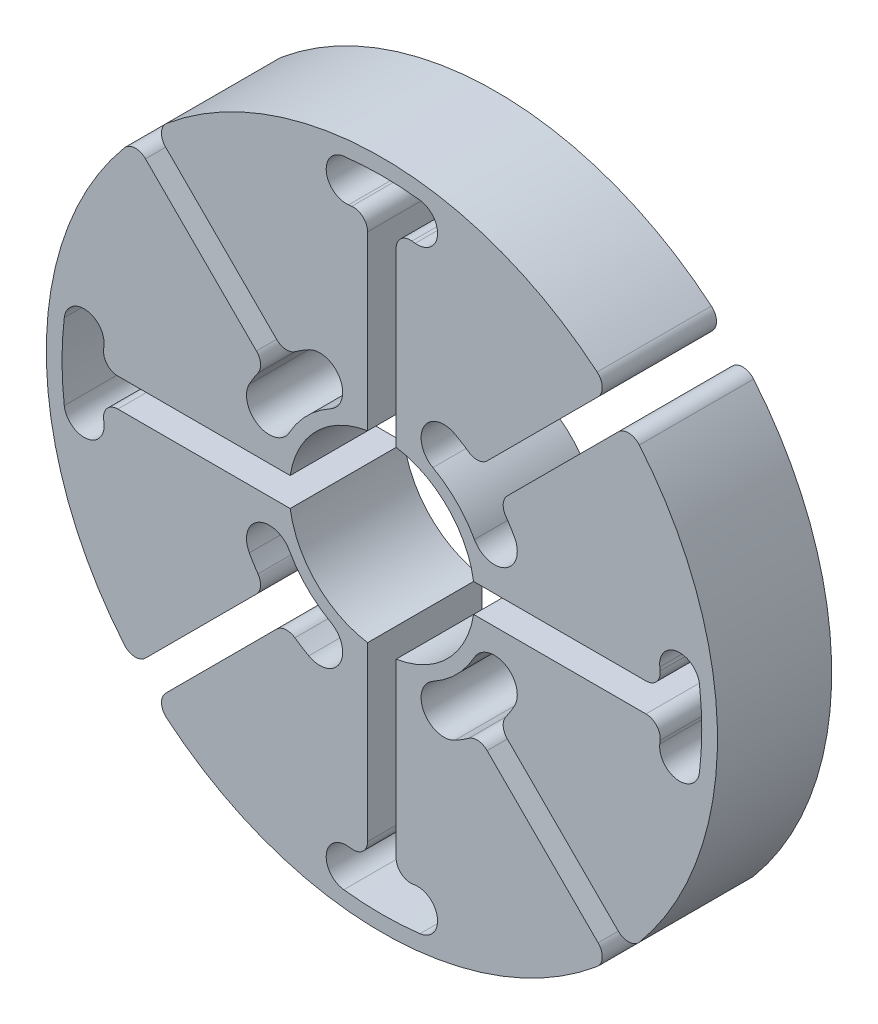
ISO-10303-21;
HEADER;
FILE_DESCRIPTION(('STEP AP214'),'2;1');
FILE_NAME('part.step','',(''),(''),'','','');
FILE_SCHEMA(('AUTOMOTIVE_DESIGN { 1 0 10303 214 1 1 1 1 }'));
ENDSEC;
DATA;
#1=APPLICATION_CONTEXT('core data for automotive mechanical design processes');
#2=APPLICATION_PROTOCOL_DEFINITION('international standard','automotive_design',2000,#1);
#3=PRODUCT_CONTEXT('',#1,'mechanical');
#4=PRODUCT('Part','Part','',(#3));
#5=PRODUCT_RELATED_PRODUCT_CATEGORY('part','',(#4));
#6=PRODUCT_DEFINITION_FORMATION('','',#4);
#7=PRODUCT_DEFINITION_CONTEXT('part definition',#1,'design');
#8=PRODUCT_DEFINITION('design','',#6,#7);
#9=PRODUCT_DEFINITION_SHAPE('','',#8);
#10=(LENGTH_UNIT() NAMED_UNIT(*) SI_UNIT(.MILLI.,.METRE.));
#11=(NAMED_UNIT(*) PLANE_ANGLE_UNIT() SI_UNIT($,.RADIAN.));
#12=(NAMED_UNIT(*) SI_UNIT($,.STERADIAN.) SOLID_ANGLE_UNIT());
#13=UNCERTAINTY_MEASURE_WITH_UNIT(LENGTH_MEASURE(1.E-05),#10,'distance_accuracy_value','');
#14=(GEOMETRIC_REPRESENTATION_CONTEXT(3) GLOBAL_UNCERTAINTY_ASSIGNED_CONTEXT((#13)) GLOBAL_UNIT_ASSIGNED_CONTEXT((#10,
#11,#12)) REPRESENTATION_CONTEXT('',''));
#15=CARTESIAN_POINT('',(0.,0.,0.));
#16=DIRECTION('',(0.,0.,1.));
#17=DIRECTION('',(1.,0.,0.));
#18=AXIS2_PLACEMENT_3D('',#15,#16,#17);
#19=CARTESIAN_POINT('',(0.,0.,5.08));
#20=DIRECTION('',(0.,0.,1.));
#21=DIRECTION('',(1.,0.,0.));
#22=AXIS2_PLACEMENT_3D('',#19,#20,#21);
#23=PLANE('',#22);
#24=DIRECTION('',(-1.,0.,0.));
#25=VECTOR('',#24,1.);
#26=CARTESIAN_POINT('',(0.,1.27,5.08));
#27=LINE('',#26,#25);
#28=CARTESIAN_POINT('',(23.4850438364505,1.27000000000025,5.08));
#29=VERTEX_POINT('',#28);
#30=CARTESIAN_POINT('',(8.15672268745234,1.27000000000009,5.08));
#31=VERTEX_POINT('',#30);
#32=EDGE_CURVE('E831',#29,#31,#27,.T.);
#33=ORIENTED_EDGE('',*,*,#32,.F.);
#34=CARTESIAN_POINT('',(23.4850438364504,2.54000000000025,5.08));
#35=DIRECTION('',(0.,0.,1.));
#36=DIRECTION('',(1.,0.,0.));
#37=AXIS2_PLACEMENT_3D('',#34,#35,#36);
#38=CIRCLE('',#37,1.27);
#39=CARTESIAN_POINT('',(24.747680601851,2.67655913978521,5.08));
#40=VERTEX_POINT('',#39);
#41=EDGE_CURVE('E1155',#29,#40,#38,.T.);
#42=ORIENTED_EDGE('',*,*,#41,.T.);
#43=CARTESIAN_POINT('',(0.,0.,5.08));
#44=DIRECTION('',(0.,0.,1.));
#45=DIRECTION('',(0.,-1.,0.));
#46=AXIS2_PLACEMENT_3D('',#43,#44,#45);
#47=CIRCLE('',#46,24.892);
#48=CARTESIAN_POINT('',(24.7149816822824,2.96333333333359,5.08));
#49=VERTEX_POINT('',#48);
#50=EDGE_CURVE('E852',#40,#49,#47,.T.);
#51=ORIENTED_EDGE('',*,*,#50,.T.);
#52=CARTESIAN_POINT('',(26.4803375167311,3.17500000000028,5.08));
#53=DIRECTION('',(0.,0.,1.));
#54=DIRECTION('',(0.,-1.,0.));
#55=AXIS2_PLACEMENT_3D('',#52,#53,#54);
#56=CIRCLE('',#55,1.778);
#57=CARTESIAN_POINT('',(28.2456933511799,3.38666666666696,5.08));
#58=VERTEX_POINT('',#57);
#59=EDGE_CURVE('E858',#58,#49,#56,.T.);
#60=ORIENTED_EDGE('',*,*,#59,.F.);
#61=CARTESIAN_POINT('',(0.,0.,5.08));
#62=DIRECTION('',(0.,0.,1.));
#63=DIRECTION('',(0.,-1.,0.));
#64=AXIS2_PLACEMENT_3D('',#61,#62,#63);
#65=CIRCLE('',#64,28.448);
#66=CARTESIAN_POINT('',(28.2456933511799,-3.38666666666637,5.08));
#67=VERTEX_POINT('',#66);
#68=EDGE_CURVE('E855',#67,#58,#65,.T.);
#69=ORIENTED_EDGE('',*,*,#68,.F.);
#70=CARTESIAN_POINT('',(26.4803375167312,-3.17499999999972,5.08));
#71=DIRECTION('',(0.,0.,1.));
#72=DIRECTION('',(0.,-1.,0.));
#73=AXIS2_PLACEMENT_3D('',#70,#71,#72);
#74=CIRCLE('',#73,1.778);
#75=CARTESIAN_POINT('',(24.7149816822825,-2.96333333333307,5.08));
#76=VERTEX_POINT('',#75);
#77=EDGE_CURVE('E851',#76,#67,#74,.T.);
#78=ORIENTED_EDGE('',*,*,#77,.F.);
#79=CARTESIAN_POINT('',(24.7476806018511,-2.67655913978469,5.08));
#80=VERTEX_POINT('',#79);
#81=EDGE_CURVE('E848',#76,#80,#47,.T.);
#82=ORIENTED_EDGE('',*,*,#81,.T.);
#83=CARTESIAN_POINT('',(23.4850438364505,-2.53999999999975,5.08));
#84=DIRECTION('',(0.,0.,1.));
#85=DIRECTION('',(1.,0.,0.));
#86=AXIS2_PLACEMENT_3D('',#83,#84,#85);
#87=CIRCLE('',#86,1.27);
#88=CARTESIAN_POINT('',(23.4850438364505,-1.26999999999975,5.08));
#89=VERTEX_POINT('',#88);
#90=EDGE_CURVE('E1153',#80,#89,#87,.T.);
#91=ORIENTED_EDGE('',*,*,#90,.T.);
#92=DIRECTION('',(-1.,0.,0.));
#93=VECTOR('',#92,1.);
#94=CARTESIAN_POINT('',(0.,-1.27,5.08));
#95=LINE('',#94,#93);
#96=CARTESIAN_POINT('',(8.15672268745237,-1.26999999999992,5.08));
#97=VERTEX_POINT('',#96);
#98=EDGE_CURVE('E637',#89,#97,#95,.T.);
#99=ORIENTED_EDGE('',*,*,#98,.T.);
#100=CARTESIAN_POINT('',(0.,0.,5.08));
#101=DIRECTION('',(0.,0.,1.));
#102=DIRECTION('',(1.,0.,0.));
#103=AXIS2_PLACEMENT_3D('',#100,#101,#102);
#104=CIRCLE('',#103,8.255);
#105=CARTESIAN_POINT('',(1.27,-8.15672268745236,5.08));
#106=VERTEX_POINT('',#105);
#107=EDGE_CURVE('E1226',#106,#97,#104,.T.);
#108=ORIENTED_EDGE('',*,*,#107,.F.);
#109=DIRECTION('',(0.,1.,0.));
#110=VECTOR('',#109,1.);
#111=CARTESIAN_POINT('',(1.27,0.,5.08));
#112=LINE('',#111,#110);
#113=CARTESIAN_POINT('',(1.27,-23.4850438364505,5.08));
#114=VERTEX_POINT('',#113);
#115=EDGE_CURVE('E782',#114,#106,#112,.T.);
#116=ORIENTED_EDGE('',*,*,#115,.F.);
#117=CARTESIAN_POINT('',(2.54,-23.4850438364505,5.08));
#118=DIRECTION('',(0.,0.,1.));
#119=DIRECTION('',(1.,0.,0.));
#120=AXIS2_PLACEMENT_3D('',#117,#118,#119);
#121=CIRCLE('',#120,1.27);
#122=CARTESIAN_POINT('',(2.67655913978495,-24.747680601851,5.08));
#123=VERTEX_POINT('',#122);
#124=EDGE_CURVE('E1101',#114,#123,#121,.T.);
#125=ORIENTED_EDGE('',*,*,#124,.T.);
#126=CARTESIAN_POINT('',(0.,0.,5.08));
#127=DIRECTION('',(0.,0.,1.));
#128=DIRECTION('',(-1.,0.,0.));
#129=AXIS2_PLACEMENT_3D('',#126,#127,#128);
#130=CIRCLE('',#129,24.892);
#131=CARTESIAN_POINT('',(2.96333333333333,-24.7149816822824,5.08));
#132=VERTEX_POINT('',#131);
#133=EDGE_CURVE('E805',#123,#132,#130,.T.);
#134=ORIENTED_EDGE('',*,*,#133,.T.);
#135=CARTESIAN_POINT('',(3.175,-26.4803375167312,5.08));
#136=DIRECTION('',(0.,0.,1.));
#137=DIRECTION('',(-1.,0.,0.));
#138=AXIS2_PLACEMENT_3D('',#135,#136,#137);
#139=CIRCLE('',#138,1.778);
#140=CARTESIAN_POINT('',(3.38666666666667,-28.2456933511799,5.08));
#141=VERTEX_POINT('',#140);
#142=EDGE_CURVE('E811',#141,#132,#139,.T.);
#143=ORIENTED_EDGE('',*,*,#142,.F.);
#144=CARTESIAN_POINT('',(0.,0.,5.08));
#145=DIRECTION('',(0.,0.,1.));
#146=DIRECTION('',(-1.,0.,0.));
#147=AXIS2_PLACEMENT_3D('',#144,#145,#146);
#148=CIRCLE('',#147,28.448);
#149=CARTESIAN_POINT('',(-3.38666666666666,-28.2456933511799,5.08));
#150=VERTEX_POINT('',#149);
#151=EDGE_CURVE('E808',#150,#141,#148,.T.);
#152=ORIENTED_EDGE('',*,*,#151,.F.);
#153=CARTESIAN_POINT('',(-3.175,-26.4803375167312,5.08));
#154=DIRECTION('',(0.,0.,1.));
#155=DIRECTION('',(-1.,0.,0.));
#156=AXIS2_PLACEMENT_3D('',#153,#154,#155);
#157=CIRCLE('',#156,1.778);
#158=CARTESIAN_POINT('',(-2.96333333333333,-24.7149816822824,5.08));
#159=VERTEX_POINT('',#158);
#160=EDGE_CURVE('E804',#159,#150,#157,.T.);
#161=ORIENTED_EDGE('',*,*,#160,.F.);
#162=CARTESIAN_POINT('',(-2.67655913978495,-24.747680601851,5.08));
#163=VERTEX_POINT('',#162);
#164=EDGE_CURVE('E800',#159,#163,#130,.T.);
#165=ORIENTED_EDGE('',*,*,#164,.T.);
#166=CARTESIAN_POINT('',(-2.54,-23.4850438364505,5.08));
#167=DIRECTION('',(0.,0.,1.));
#168=DIRECTION('',(1.,0.,0.));
#169=AXIS2_PLACEMENT_3D('',#166,#167,#168);
#170=CIRCLE('',#169,1.27);
#171=CARTESIAN_POINT('',(-1.27,-23.4850438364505,5.08));
#172=VERTEX_POINT('',#171);
#173=EDGE_CURVE('E1099',#163,#172,#170,.T.);
#174=ORIENTED_EDGE('',*,*,#173,.T.);
#175=DIRECTION('',(0.,1.,0.));
#176=VECTOR('',#175,1.);
#177=CARTESIAN_POINT('',(-1.27,0.,5.08));
#178=LINE('',#177,#176);
#179=CARTESIAN_POINT('',(-1.27,-8.15672268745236,5.08));
#180=VERTEX_POINT('',#179);
#181=EDGE_CURVE('E798',#172,#180,#178,.T.);
#182=ORIENTED_EDGE('',*,*,#181,.T.);
#183=CARTESIAN_POINT('',(-8.15672268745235,-1.27000000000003,5.08));
#184=VERTEX_POINT('',#183);
#185=EDGE_CURVE('E974',#184,#180,#104,.T.);
#186=ORIENTED_EDGE('',*,*,#185,.F.);
#187=DIRECTION('',(1.,0.,0.));
#188=VECTOR('',#187,1.);
#189=CARTESIAN_POINT('',(0.,-1.27,5.08));
#190=LINE('',#189,#188);
#191=CARTESIAN_POINT('',(-23.4850438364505,-1.27000000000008,5.08));
#192=VERTEX_POINT('',#191);
#193=EDGE_CURVE('E731',#192,#184,#190,.T.);
#194=ORIENTED_EDGE('',*,*,#193,.F.);
#195=CARTESIAN_POINT('',(-23.4850438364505,-2.54000000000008,5.08));
#196=DIRECTION('',(0.,0.,1.));
#197=DIRECTION('',(1.,0.,0.));
#198=AXIS2_PLACEMENT_3D('',#195,#196,#197);
#199=CIRCLE('',#198,1.27);
#200=CARTESIAN_POINT('',(-24.747680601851,-2.67655913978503,5.08));
#201=VERTEX_POINT('',#200);
#202=EDGE_CURVE('E1049',#192,#201,#199,.T.);
#203=ORIENTED_EDGE('',*,*,#202,.T.);
#204=CARTESIAN_POINT('',(0.,0.,5.08));
#205=DIRECTION('',(0.,0.,1.));
#206=DIRECTION('',(0.,1.,0.));
#207=AXIS2_PLACEMENT_3D('',#204,#205,#206);
#208=CIRCLE('',#207,24.892);
#209=CARTESIAN_POINT('',(-24.7149816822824,-2.96333333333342,5.08));
#210=VERTEX_POINT('',#209);
#211=EDGE_CURVE('E754',#201,#210,#208,.T.);
#212=ORIENTED_EDGE('',*,*,#211,.T.);
#213=CARTESIAN_POINT('',(-26.4803375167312,-3.17500000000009,5.08));
#214=DIRECTION('',(0.,0.,1.));
#215=DIRECTION('',(0.,1.,0.));
#216=AXIS2_PLACEMENT_3D('',#213,#214,#215);
#217=CIRCLE('',#216,1.778);
#218=CARTESIAN_POINT('',(-28.2456933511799,-3.38666666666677,5.08));
#219=VERTEX_POINT('',#218);
#220=EDGE_CURVE('E760',#219,#210,#217,.T.);
#221=ORIENTED_EDGE('',*,*,#220,.F.);
#222=CARTESIAN_POINT('',(0.,0.,5.08));
#223=DIRECTION('',(0.,0.,1.));
#224=DIRECTION('',(0.,1.,0.));
#225=AXIS2_PLACEMENT_3D('',#222,#223,#224);
#226=CIRCLE('',#225,28.448);
#227=CARTESIAN_POINT('',(-28.2456933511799,3.38666666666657,5.08));
#228=VERTEX_POINT('',#227);
#229=EDGE_CURVE('E757',#228,#219,#226,.T.);
#230=ORIENTED_EDGE('',*,*,#229,.F.);
#231=CARTESIAN_POINT('',(-26.4803375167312,3.17499999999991,5.08));
#232=DIRECTION('',(0.,0.,1.));
#233=DIRECTION('',(0.,1.,0.));
#234=AXIS2_PLACEMENT_3D('',#231,#232,#233);
#235=CIRCLE('',#234,1.778);
#236=CARTESIAN_POINT('',(-24.7149816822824,2.96333333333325,5.08));
#237=VERTEX_POINT('',#236);
#238=EDGE_CURVE('E753',#237,#228,#235,.T.);
#239=ORIENTED_EDGE('',*,*,#238,.F.);
#240=CARTESIAN_POINT('',(-24.747680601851,2.67655913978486,5.08));
#241=VERTEX_POINT('',#240);
#242=EDGE_CURVE('E749',#237,#241,#208,.T.);
#243=ORIENTED_EDGE('',*,*,#242,.T.);
#244=CARTESIAN_POINT('',(-23.4850438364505,2.53999999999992,5.08));
#245=DIRECTION('',(0.,0.,1.));
#246=DIRECTION('',(1.,0.,0.));
#247=AXIS2_PLACEMENT_3D('',#244,#245,#246);
#248=CIRCLE('',#247,1.27);
#249=CARTESIAN_POINT('',(-23.4850438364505,1.26999999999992,5.08));
#250=VERTEX_POINT('',#249);
#251=EDGE_CURVE('E1047',#241,#250,#248,.T.);
#252=ORIENTED_EDGE('',*,*,#251,.T.);
#253=DIRECTION('',(1.,0.,0.));
#254=VECTOR('',#253,1.);
#255=CARTESIAN_POINT('',(0.,1.27,5.08));
#256=LINE('',#255,#254);
#257=CARTESIAN_POINT('',(-8.15672268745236,1.26999999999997,5.08));
#258=VERTEX_POINT('',#257);
#259=EDGE_CURVE('E747',#250,#258,#256,.T.);
#260=ORIENTED_EDGE('',*,*,#259,.T.);
#261=CARTESIAN_POINT('',(-1.27,8.15672268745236,5.08));
#262=VERTEX_POINT('',#261);
#263=EDGE_CURVE('E970',#262,#258,#104,.T.);
#264=ORIENTED_EDGE('',*,*,#263,.F.);
#265=DIRECTION('',(0.,-1.,0.));
#266=VECTOR('',#265,1.);
#267=CARTESIAN_POINT('',(-1.27,0.,5.08));
#268=LINE('',#267,#266);
#269=CARTESIAN_POINT('',(-1.27,23.4850438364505,5.08));
#270=VERTEX_POINT('',#269);
#271=EDGE_CURVE('E923',#270,#262,#268,.T.);
#272=ORIENTED_EDGE('',*,*,#271,.F.);
#273=CARTESIAN_POINT('',(-2.54,23.4850438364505,5.08));
#274=DIRECTION('',(0.,0.,1.));
#275=DIRECTION('',(1.,0.,0.));
#276=AXIS2_PLACEMENT_3D('',#273,#274,#275);
#277=CIRCLE('',#276,1.27);
#278=CARTESIAN_POINT('',(-2.67655913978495,24.747680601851,5.08));
#279=VERTEX_POINT('',#278);
#280=EDGE_CURVE('E996',#270,#279,#277,.T.);
#281=ORIENTED_EDGE('',*,*,#280,.T.);
#282=CARTESIAN_POINT('',(0.,0.,5.08));
#283=DIRECTION('',(0.,0.,1.));
#284=DIRECTION('',(1.,0.,0.));
#285=AXIS2_PLACEMENT_3D('',#282,#283,#284);
#286=CIRCLE('',#285,24.892);
#287=CARTESIAN_POINT('',(-2.96333333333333,24.7149816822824,5.08));
#288=VERTEX_POINT('',#287);
#289=EDGE_CURVE('E945',#279,#288,#286,.T.);
#290=ORIENTED_EDGE('',*,*,#289,.T.);
#291=CARTESIAN_POINT('',(-3.175,26.4803375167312,5.08));
#292=DIRECTION('',(0.,0.,1.));
#293=DIRECTION('',(1.,0.,0.));
#294=AXIS2_PLACEMENT_3D('',#291,#292,#293);
#295=CIRCLE('',#294,1.778);
#296=CARTESIAN_POINT('',(-3.38666666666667,28.2456933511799,5.08));
#297=VERTEX_POINT('',#296);
#298=EDGE_CURVE('E951',#297,#288,#295,.T.);
#299=ORIENTED_EDGE('',*,*,#298,.F.);
#300=CARTESIAN_POINT('',(0.,0.,5.08));
#301=DIRECTION('',(0.,0.,1.));
#302=DIRECTION('',(1.,0.,0.));
#303=AXIS2_PLACEMENT_3D('',#300,#301,#302);
#304=CIRCLE('',#303,28.448);
#305=CARTESIAN_POINT('',(3.38666666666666,28.2456933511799,5.08));
#306=VERTEX_POINT('',#305);
#307=EDGE_CURVE('E948',#306,#297,#304,.T.);
#308=ORIENTED_EDGE('',*,*,#307,.F.);
#309=CARTESIAN_POINT('',(3.175,26.4803375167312,5.08));
#310=DIRECTION('',(0.,0.,1.));
#311=DIRECTION('',(1.,0.,0.));
#312=AXIS2_PLACEMENT_3D('',#309,#310,#311);
#313=CIRCLE('',#312,1.778);
#314=CARTESIAN_POINT('',(2.96333333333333,24.7149816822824,5.08));
#315=VERTEX_POINT('',#314);
#316=EDGE_CURVE('E944',#315,#306,#313,.T.);
#317=ORIENTED_EDGE('',*,*,#316,.F.);
#318=CARTESIAN_POINT('',(2.67655913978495,24.747680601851,5.08));
#319=VERTEX_POINT('',#318);
#320=EDGE_CURVE('E941',#315,#319,#286,.T.);
#321=ORIENTED_EDGE('',*,*,#320,.T.);
#322=CARTESIAN_POINT('',(2.54,23.4850438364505,5.08));
#323=DIRECTION('',(0.,0.,1.));
#324=DIRECTION('',(1.,0.,0.));
#325=AXIS2_PLACEMENT_3D('',#322,#323,#324);
#326=CIRCLE('',#325,1.27);
#327=CARTESIAN_POINT('',(1.27,23.4850438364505,5.08));
#328=VERTEX_POINT('',#327);
#329=EDGE_CURVE('E994',#319,#328,#326,.T.);
#330=ORIENTED_EDGE('',*,*,#329,.T.);
#331=DIRECTION('',(0.,-1.,0.));
#332=VECTOR('',#331,1.);
#333=CARTESIAN_POINT('',(1.27,0.,5.08));
#334=LINE('',#333,#332);
#335=CARTESIAN_POINT('',(1.27,8.15672268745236,5.08));
#336=VERTEX_POINT('',#335);
#337=EDGE_CURVE('E912',#328,#336,#334,.T.);
#338=ORIENTED_EDGE('',*,*,#337,.T.);
#339=EDGE_CURVE('E975',#31,#336,#104,.T.);
#340=ORIENTED_EDGE('',*,*,#339,.F.);
#341=EDGE_LOOP('',(#33,#42,#51,#60,#69,#78,#82,#91,#99,#108,#116,#125,#134,#143,#152,#161,#165,
#174,#182,#186,#194,#203,#212,#221,#230,#239,#243,#252,#260,#264,#272,#281,#290,#299,#308,#317,
#321,#330,#338,#340));
#342=FACE_BOUND('',#341,.T.);
#343=CARTESIAN_POINT('',(0.,0.,5.08));
#344=DIRECTION('',(0.,0.,1.));
#345=DIRECTION('',(1.,0.,0.));
#346=AXIS2_PLACEMENT_3D('',#343,#344,#345);
#347=CIRCLE('',#346,29.845);
#348=CARTESIAN_POINT('',(22.8959400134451,-19.14418856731,5.08));
#349=VERTEX_POINT('',#348);
#350=CARTESIAN_POINT('',(22.8959400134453,19.1441885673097,5.08));
#351=VERTEX_POINT('',#350);
#352=EDGE_CURVE('E2273',#349,#351,#347,.T.);
#353=ORIENTED_EDGE('',*,*,#352,.T.);
#354=CARTESIAN_POINT('',(21.9216446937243,18.3295422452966,5.08));
#355=DIRECTION('',(0.,0.,1.));
#356=DIRECTION('',(1.,0.,0.));
#357=AXIS2_PLACEMENT_3D('',#354,#355,#356);
#358=CIRCLE('',#357,1.27);
#359=CARTESIAN_POINT('',(21.0236190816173,19.2275678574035,5.08));
#360=VERTEX_POINT('',#359);
#361=EDGE_CURVE('E1163',#351,#360,#358,.T.);
#362=ORIENTED_EDGE('',*,*,#361,.T.);
#363=DIRECTION('',(-0.707106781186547,-0.707106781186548,0.));
#364=VECTOR('',#363,1.);
#365=CARTESIAN_POINT('',(0.898025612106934,-0.898025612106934,5.08));
#366=LINE('',#365,#364);
#367=CARTESIAN_POINT('',(11.1591226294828,9.36307140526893,5.08));
#368=VERTEX_POINT('',#367);
#369=EDGE_CURVE('E689',#360,#368,#366,.T.);
#370=ORIENTED_EDGE('',*,*,#369,.T.);
#371=CARTESIAN_POINT('',(12.0571482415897,8.46504579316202,5.08));
#372=DIRECTION('',(0.,0.,1.));
#373=DIRECTION('',(1.,0.,0.));
#374=AXIS2_PLACEMENT_3D('',#371,#372,#373);
#375=CIRCLE('',#374,1.27);
#376=CARTESIAN_POINT('',(11.0177389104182,7.73530046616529,5.08));
#377=VERTEX_POINT('',#376);
#378=EDGE_CURVE('E1159',#368,#377,#375,.T.);
#379=ORIENTED_EDGE('',*,*,#378,.T.);
#380=CARTESIAN_POINT('',(0.,0.,5.08));
#381=DIRECTION('',(0.,0.,1.));
#382=DIRECTION('',(0.,-1.,0.));
#383=AXIS2_PLACEMENT_3D('',#380,#381,#382);
#384=CIRCLE('',#383,13.462);
#385=CARTESIAN_POINT('',(11.7886383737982,6.50026532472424,5.08));
#386=VERTEX_POINT('',#385);
#387=EDGE_CURVE('E710',#386,#377,#384,.T.);
#388=ORIENTED_EDGE('',*,*,#387,.F.);
#389=CARTESIAN_POINT('',(10.0092212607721,5.51909320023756,5.08));
#390=DIRECTION('',(0.,0.,1.));
#391=DIRECTION('',(0.,-1.,0.));
#392=AXIS2_PLACEMENT_3D('',#389,#390,#391);
#393=CIRCLE('',#392,2.032);
#394=CARTESIAN_POINT('',(8.22980414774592,4.53792107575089,5.08));
#395=VERTEX_POINT('',#394);
#396=EDGE_CURVE('E716',#395,#386,#393,.T.);
#397=ORIENTED_EDGE('',*,*,#396,.F.);
#398=CARTESIAN_POINT('',(0.,0.,5.08));
#399=DIRECTION('',(0.,0.,1.));
#400=DIRECTION('',(0.,-1.,0.));
#401=AXIS2_PLACEMENT_3D('',#398,#399,#400);
#402=CIRCLE('',#401,9.398);
#403=CARTESIAN_POINT('',(4.5379210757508,8.22980414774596,5.08));
#404=VERTEX_POINT('',#403);
#405=EDGE_CURVE('E713',#395,#404,#402,.T.);
#406=ORIENTED_EDGE('',*,*,#405,.T.);
#407=CARTESIAN_POINT('',(5.51909320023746,10.0092212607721,5.08));
#408=DIRECTION('',(0.,0.,1.));
#409=DIRECTION('',(0.,-1.,0.));
#410=AXIS2_PLACEMENT_3D('',#407,#408,#409);
#411=CIRCLE('',#410,2.032);
#412=CARTESIAN_POINT('',(6.50026532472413,11.7886383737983,5.08));
#413=VERTEX_POINT('',#412);
#414=EDGE_CURVE('E709',#413,#404,#411,.T.);
#415=ORIENTED_EDGE('',*,*,#414,.F.);
#416=CARTESIAN_POINT('',(7.73530046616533,11.0177389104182,5.08));
#417=VERTEX_POINT('',#416);
#418=EDGE_CURVE('E707',#417,#413,#384,.T.);
#419=ORIENTED_EDGE('',*,*,#418,.F.);
#420=CARTESIAN_POINT('',(8.46504579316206,12.0571482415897,5.08));
#421=DIRECTION('',(0.,0.,1.));
#422=DIRECTION('',(1.,0.,0.));
#423=AXIS2_PLACEMENT_3D('',#420,#421,#422);
#424=CIRCLE('',#423,1.27);
#425=CARTESIAN_POINT('',(9.36307140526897,11.1591226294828,5.08));
#426=VERTEX_POINT('',#425);
#427=EDGE_CURVE('E1157',#417,#426,#424,.T.);
#428=ORIENTED_EDGE('',*,*,#427,.T.);
#429=DIRECTION('',(0.707106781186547,0.707106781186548,0.));
#430=VECTOR('',#429,1.);
#431=CARTESIAN_POINT('',(-0.898025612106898,0.898025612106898,5.08));
#432=LINE('',#431,#430);
#433=CARTESIAN_POINT('',(19.2275678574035,21.0236190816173,5.08));
#434=VERTEX_POINT('',#433);
#435=EDGE_CURVE('E704',#426,#434,#432,.T.);
#436=ORIENTED_EDGE('',*,*,#435,.T.);
#437=CARTESIAN_POINT('',(18.3295422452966,21.9216446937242,5.08));
#438=DIRECTION('',(0.,0.,1.));
#439=DIRECTION('',(1.,0.,0.));
#440=AXIS2_PLACEMENT_3D('',#437,#438,#439);
#441=CIRCLE('',#440,1.27);
#442=CARTESIAN_POINT('',(19.1441885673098,22.8959400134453,5.08));
#443=VERTEX_POINT('',#442);
#444=EDGE_CURVE('E1161',#434,#443,#441,.T.);
#445=ORIENTED_EDGE('',*,*,#444,.T.);
#446=CARTESIAN_POINT('',(-19.1441885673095,22.8959400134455,5.08));
#447=VERTEX_POINT('',#446);
#448=EDGE_CURVE('E985',#443,#447,#347,.T.);
#449=ORIENTED_EDGE('',*,*,#448,.T.);
#450=CARTESIAN_POINT('',(-18.3295422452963,21.9216446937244,5.08));
#451=DIRECTION('',(0.,0.,1.));
#452=DIRECTION('',(1.,0.,0.));
#453=AXIS2_PLACEMENT_3D('',#450,#451,#452);
#454=CIRCLE('',#453,1.27);
#455=CARTESIAN_POINT('',(-19.2275678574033,21.0236190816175,5.08));
#456=VERTEX_POINT('',#455);
#457=EDGE_CURVE('E1004',#447,#456,#454,.T.);
#458=ORIENTED_EDGE('',*,*,#457,.T.);
#459=DIRECTION('',(0.70710678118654,-0.707106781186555,0.));
#460=VECTOR('',#459,1.);
#461=CARTESIAN_POINT('',(0.898025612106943,0.898025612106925,5.08));
#462=LINE('',#461,#460);
#463=CARTESIAN_POINT('',(-9.36307140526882,11.1591226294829,5.08));
#464=VERTEX_POINT('',#463);
#465=EDGE_CURVE('E879',#456,#464,#462,.T.);
#466=ORIENTED_EDGE('',*,*,#465,.T.);
#467=CARTESIAN_POINT('',(-8.4650457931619,12.0571482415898,5.08));
#468=DIRECTION('',(0.,0.,1.));
#469=DIRECTION('',(1.,0.,0.));
#470=AXIS2_PLACEMENT_3D('',#467,#468,#469);
#471=CIRCLE('',#470,1.27);
#472=CARTESIAN_POINT('',(-7.73530046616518,11.0177389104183,5.08));
#473=VERTEX_POINT('',#472);
#474=EDGE_CURVE('E1000',#464,#473,#471,.T.);
#475=ORIENTED_EDGE('',*,*,#474,.T.);
#476=CARTESIAN_POINT('',(0.,0.,5.08));
#477=DIRECTION('',(0.,0.,1.));
#478=DIRECTION('',(1.,0.,0.));
#479=AXIS2_PLACEMENT_3D('',#476,#477,#478);
#480=CIRCLE('',#479,13.462);
#481=CARTESIAN_POINT('',(-6.50026532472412,11.7886383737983,5.08));
#482=VERTEX_POINT('',#481);
#483=EDGE_CURVE('E899',#482,#473,#480,.T.);
#484=ORIENTED_EDGE('',*,*,#483,.F.);
#485=CARTESIAN_POINT('',(-5.51909320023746,10.0092212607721,5.08));
#486=DIRECTION('',(0.,0.,1.));
#487=DIRECTION('',(1.,0.,0.));
#488=AXIS2_PLACEMENT_3D('',#485,#486,#487);
#489=CIRCLE('',#488,2.032);
#490=CARTESIAN_POINT('',(-4.5379210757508,8.22980414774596,5.08));
#491=VERTEX_POINT('',#490);
#492=EDGE_CURVE('E905',#491,#482,#489,.T.);
#493=ORIENTED_EDGE('',*,*,#492,.F.);
#494=CARTESIAN_POINT('',(0.,0.,5.08));
#495=DIRECTION('',(0.,0.,1.));
#496=DIRECTION('',(1.,0.,0.));
#497=AXIS2_PLACEMENT_3D('',#494,#495,#496);
#498=CIRCLE('',#497,9.398);
#499=CARTESIAN_POINT('',(-8.22980414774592,4.53792107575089,5.08));
#500=VERTEX_POINT('',#499);
#501=EDGE_CURVE('E902',#491,#500,#498,.T.);
#502=ORIENTED_EDGE('',*,*,#501,.T.);
#503=CARTESIAN_POINT('',(-10.0092212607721,5.51909320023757,5.08));
#504=DIRECTION('',(0.,0.,1.));
#505=DIRECTION('',(1.,0.,0.));
#506=AXIS2_PLACEMENT_3D('',#503,#504,#505);
#507=CIRCLE('',#506,2.032);
#508=CARTESIAN_POINT('',(-11.7886383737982,6.50026532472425,5.08));
#509=VERTEX_POINT('',#508);
#510=EDGE_CURVE('E898',#509,#500,#507,.T.);
#511=ORIENTED_EDGE('',*,*,#510,.F.);
#512=CARTESIAN_POINT('',(-11.0177389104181,7.73530046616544,5.08));
#513=VERTEX_POINT('',#512);
#514=EDGE_CURVE('E896',#513,#509,#480,.T.);
#515=ORIENTED_EDGE('',*,*,#514,.F.);
#516=CARTESIAN_POINT('',(-12.0571482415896,8.46504579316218,5.08));
#517=DIRECTION('',(0.,0.,1.));
#518=DIRECTION('',(1.,0.,0.));
#519=AXIS2_PLACEMENT_3D('',#516,#517,#518);
#520=CIRCLE('',#519,1.27);
#521=CARTESIAN_POINT('',(-11.1591226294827,9.36307140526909,5.08));
#522=VERTEX_POINT('',#521);
#523=EDGE_CURVE('E998',#513,#522,#520,.T.);
#524=ORIENTED_EDGE('',*,*,#523,.T.);
#525=DIRECTION('',(-0.70710678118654,0.707106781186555,0.));
#526=VECTOR('',#525,1.);
#527=CARTESIAN_POINT('',(-0.898025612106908,-0.898025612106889,5.08));
#528=LINE('',#527,#526);
#529=CARTESIAN_POINT('',(-21.0236190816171,19.2275678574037,5.08));
#530=VERTEX_POINT('',#529);
#531=EDGE_CURVE('E767',#522,#530,#528,.T.);
#532=ORIENTED_EDGE('',*,*,#531,.T.);
#533=CARTESIAN_POINT('',(-21.921644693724,18.3295422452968,5.08));
#534=DIRECTION('',(0.,0.,1.));
#535=DIRECTION('',(1.,0.,0.));
#536=AXIS2_PLACEMENT_3D('',#533,#534,#535);
#537=CIRCLE('',#536,1.27);
#538=CARTESIAN_POINT('',(-22.8959400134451,19.14418856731,5.08));
#539=VERTEX_POINT('',#538);
#540=EDGE_CURVE('E1002',#530,#539,#537,.T.);
#541=ORIENTED_EDGE('',*,*,#540,.T.);
#542=CARTESIAN_POINT('',(-22.8959400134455,-19.1441885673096,5.08));
#543=VERTEX_POINT('',#542);
#544=EDGE_CURVE('E980',#539,#543,#347,.T.);
#545=ORIENTED_EDGE('',*,*,#544,.T.);
#546=CARTESIAN_POINT('',(-21.9216446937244,-18.3295422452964,5.08));
#547=DIRECTION('',(0.,0.,1.));
#548=DIRECTION('',(1.,0.,0.));
#549=AXIS2_PLACEMENT_3D('',#546,#547,#548);
#550=CIRCLE('',#549,1.27);
#551=CARTESIAN_POINT('',(-21.0236190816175,-19.2275678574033,5.08));
#552=VERTEX_POINT('',#551);
#553=EDGE_CURVE('E1057',#543,#552,#550,.T.);
#554=ORIENTED_EDGE('',*,*,#553,.T.);
#555=DIRECTION('',(0.707106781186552,0.707106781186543,0.));
#556=VECTOR('',#555,1.);
#557=CARTESIAN_POINT('',(-0.898025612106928,0.89802561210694,5.08));
#558=LINE('',#557,#556);
#559=CARTESIAN_POINT('',(-11.1591226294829,-9.36307140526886,5.08));
#560=VERTEX_POINT('',#559);
#561=EDGE_CURVE('E632',#552,#560,#558,.T.);
#562=ORIENTED_EDGE('',*,*,#561,.T.);
#563=CARTESIAN_POINT('',(-12.0571482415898,-8.46504579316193,5.08));
#564=DIRECTION('',(0.,0.,1.));
#565=DIRECTION('',(1.,0.,0.));
#566=AXIS2_PLACEMENT_3D('',#563,#564,#565);
#567=CIRCLE('',#566,1.27);
#568=CARTESIAN_POINT('',(-11.0177389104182,-7.73530046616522,5.08));
#569=VERTEX_POINT('',#568);
#570=EDGE_CURVE('E1053',#560,#569,#567,.T.);
#571=ORIENTED_EDGE('',*,*,#570,.T.);
#572=CARTESIAN_POINT('',(0.,0.,5.08));
#573=DIRECTION('',(0.,0.,1.));
#574=DIRECTION('',(0.,1.,0.));
#575=AXIS2_PLACEMENT_3D('',#572,#573,#574);
#576=CIRCLE('',#575,13.462);
#577=CARTESIAN_POINT('',(-11.7886383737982,-6.50026532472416,5.08));
#578=VERTEX_POINT('',#577);
#579=EDGE_CURVE('E624',#578,#569,#576,.T.);
#580=ORIENTED_EDGE('',*,*,#579,.F.);
#581=CARTESIAN_POINT('',(-10.0092212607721,-5.51909320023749,5.08));
#582=DIRECTION('',(0.,0.,1.));
#583=DIRECTION('',(0.,1.,0.));
#584=AXIS2_PLACEMENT_3D('',#581,#582,#583);
#585=CIRCLE('',#584,2.032);
#586=CARTESIAN_POINT('',(-8.22980414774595,-4.53792107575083,5.08));
#587=VERTEX_POINT('',#586);
#588=EDGE_CURVE('E629',#587,#578,#585,.T.);
#589=ORIENTED_EDGE('',*,*,#588,.F.);
#590=CARTESIAN_POINT('',(0.,0.,5.08));
#591=DIRECTION('',(0.,0.,1.));
#592=DIRECTION('',(0.,1.,0.));
#593=AXIS2_PLACEMENT_3D('',#590,#591,#592);
#594=CIRCLE('',#593,9.398);
#595=CARTESIAN_POINT('',(-4.53792107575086,-8.22980414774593,5.08));
#596=VERTEX_POINT('',#595);
#597=EDGE_CURVE('E626',#587,#596,#594,.T.);
#598=ORIENTED_EDGE('',*,*,#597,.T.);
#599=CARTESIAN_POINT('',(-5.51909320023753,-10.0092212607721,5.08));
#600=DIRECTION('',(0.,0.,1.));
#601=DIRECTION('',(0.,1.,0.));
#602=AXIS2_PLACEMENT_3D('',#599,#600,#601);
#603=CIRCLE('',#602,2.032);
#604=CARTESIAN_POINT('',(-6.50026532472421,-11.7886383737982,5.08));
#605=VERTEX_POINT('',#604);
#606=EDGE_CURVE('E623',#605,#596,#603,.T.);
#607=ORIENTED_EDGE('',*,*,#606,.F.);
#608=CARTESIAN_POINT('',(-7.73530046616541,-11.0177389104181,5.08));
#609=VERTEX_POINT('',#608);
#610=EDGE_CURVE('E599',#609,#605,#576,.T.);
#611=ORIENTED_EDGE('',*,*,#610,.F.);
#612=CARTESIAN_POINT('',(-8.46504579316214,-12.0571482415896,5.08));
#613=DIRECTION('',(0.,0.,1.));
#614=DIRECTION('',(1.,0.,0.));
#615=AXIS2_PLACEMENT_3D('',#612,#613,#614);
#616=CIRCLE('',#615,1.27);
#617=CARTESIAN_POINT('',(-9.36307140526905,-11.1591226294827,5.08));
#618=VERTEX_POINT('',#617);
#619=EDGE_CURVE('E1051',#609,#618,#616,.T.);
#620=ORIENTED_EDGE('',*,*,#619,.T.);
#621=DIRECTION('',(-0.707106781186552,-0.707106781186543,0.));
#622=VECTOR('',#621,1.);
#623=CARTESIAN_POINT('',(0.898025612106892,-0.898025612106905,5.08));
#624=LINE('',#623,#622);
#625=CARTESIAN_POINT('',(-19.2275678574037,-21.0236190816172,5.08));
#626=VERTEX_POINT('',#625);
#627=EDGE_CURVE('E618',#618,#626,#624,.T.);
#628=ORIENTED_EDGE('',*,*,#627,.T.);
#629=CARTESIAN_POINT('',(-18.3295422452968,-21.9216446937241,5.08));
#630=DIRECTION('',(0.,0.,1.));
#631=DIRECTION('',(1.,0.,0.));
#632=AXIS2_PLACEMENT_3D('',#629,#630,#631);
#633=CIRCLE('',#632,1.27);
#634=CARTESIAN_POINT('',(-19.1441885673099,-22.8959400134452,5.08));
#635=VERTEX_POINT('',#634);
#636=EDGE_CURVE('E1055',#626,#635,#633,.T.);
#637=ORIENTED_EDGE('',*,*,#636,.T.);
#638=CARTESIAN_POINT('',(19.1441885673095,-22.8959400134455,5.08));
#639=VERTEX_POINT('',#638);
#640=EDGE_CURVE('E984',#635,#639,#347,.T.);
#641=ORIENTED_EDGE('',*,*,#640,.T.);
#642=CARTESIAN_POINT('',(18.3295422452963,-21.9216446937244,5.08));
#643=DIRECTION('',(0.,0.,1.));
#644=DIRECTION('',(1.,0.,0.));
#645=AXIS2_PLACEMENT_3D('',#642,#643,#644);
#646=CIRCLE('',#645,1.27);
#647=CARTESIAN_POINT('',(19.2275678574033,-21.0236190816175,5.08));
#648=VERTEX_POINT('',#647);
#649=EDGE_CURVE('E1109',#639,#648,#646,.T.);
#650=ORIENTED_EDGE('',*,*,#649,.T.);
#651=DIRECTION('',(-0.70710678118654,0.707106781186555,0.));
#652=VECTOR('',#651,1.);
#653=CARTESIAN_POINT('',(-0.898025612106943,-0.898025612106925,5.08));
#654=LINE('',#653,#652);
#655=CARTESIAN_POINT('',(9.36307140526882,-11.1591226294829,5.08));
#656=VERTEX_POINT('',#655);
#657=EDGE_CURVE('E645',#648,#656,#654,.T.);
#658=ORIENTED_EDGE('',*,*,#657,.T.);
#659=CARTESIAN_POINT('',(8.4650457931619,-12.0571482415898,5.08));
#660=DIRECTION('',(0.,0.,1.));
#661=DIRECTION('',(1.,0.,0.));
#662=AXIS2_PLACEMENT_3D('',#659,#660,#661);
#663=CIRCLE('',#662,1.27);
#664=CARTESIAN_POINT('',(7.73530046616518,-11.0177389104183,5.08));
#665=VERTEX_POINT('',#664);
#666=EDGE_CURVE('E1105',#656,#665,#663,.T.);
#667=ORIENTED_EDGE('',*,*,#666,.T.);
#668=CARTESIAN_POINT('',(0.,0.,5.08));
#669=DIRECTION('',(0.,0.,1.));
#670=DIRECTION('',(-1.,0.,0.));
#671=AXIS2_PLACEMENT_3D('',#668,#669,#670);
#672=CIRCLE('',#671,13.462);
#673=CARTESIAN_POINT('',(6.50026532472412,-11.7886383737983,5.08));
#674=VERTEX_POINT('',#673);
#675=EDGE_CURVE('E667',#674,#665,#672,.T.);
#676=ORIENTED_EDGE('',*,*,#675,.F.);
#677=CARTESIAN_POINT('',(5.51909320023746,-10.0092212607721,5.08));
#678=DIRECTION('',(0.,0.,1.));
#679=DIRECTION('',(-1.,0.,0.));
#680=AXIS2_PLACEMENT_3D('',#677,#678,#679);
#681=CIRCLE('',#680,2.032);
#682=CARTESIAN_POINT('',(4.5379210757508,-8.22980414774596,5.08));
#683=VERTEX_POINT('',#682);
#684=EDGE_CURVE('E673',#683,#674,#681,.T.);
#685=ORIENTED_EDGE('',*,*,#684,.F.);
#686=CARTESIAN_POINT('',(0.,0.,5.08));
#687=DIRECTION('',(0.,0.,1.));
#688=DIRECTION('',(-1.,0.,0.));
#689=AXIS2_PLACEMENT_3D('',#686,#687,#688);
#690=CIRCLE('',#689,9.398);
#691=CARTESIAN_POINT('',(8.22980414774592,-4.53792107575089,5.08));
#692=VERTEX_POINT('',#691);
#693=EDGE_CURVE('E670',#683,#692,#690,.T.);
#694=ORIENTED_EDGE('',*,*,#693,.T.);
#695=CARTESIAN_POINT('',(10.0092212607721,-5.51909320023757,5.08));
#696=DIRECTION('',(0.,0.,1.));
#697=DIRECTION('',(-1.,0.,0.));
#698=AXIS2_PLACEMENT_3D('',#695,#696,#697);
#699=CIRCLE('',#698,2.032);
#700=CARTESIAN_POINT('',(11.7886383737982,-6.50026532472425,5.08));
#701=VERTEX_POINT('',#700);
#702=EDGE_CURVE('E666',#701,#692,#699,.T.);
#703=ORIENTED_EDGE('',*,*,#702,.F.);
#704=CARTESIAN_POINT('',(11.0177389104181,-7.73530046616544,5.08));
#705=VERTEX_POINT('',#704);
#706=EDGE_CURVE('E663',#705,#701,#672,.T.);
#707=ORIENTED_EDGE('',*,*,#706,.F.);
#708=CARTESIAN_POINT('',(12.0571482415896,-8.46504579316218,5.08));
#709=DIRECTION('',(0.,0.,1.));
#710=DIRECTION('',(1.,0.,0.));
#711=AXIS2_PLACEMENT_3D('',#708,#709,#710);
#712=CIRCLE('',#711,1.27);
#713=CARTESIAN_POINT('',(11.1591226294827,-9.36307140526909,5.08));
#714=VERTEX_POINT('',#713);
#715=EDGE_CURVE('E1103',#705,#714,#712,.T.);
#716=ORIENTED_EDGE('',*,*,#715,.T.);
#717=DIRECTION('',(0.70710678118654,-0.707106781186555,0.));
#718=VECTOR('',#717,1.);
#719=CARTESIAN_POINT('',(0.898025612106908,0.898025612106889,5.08));
#720=LINE('',#719,#718);
#721=CARTESIAN_POINT('',(21.0236190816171,-19.2275678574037,5.08));
#722=VERTEX_POINT('',#721);
#723=EDGE_CURVE('E660',#714,#722,#720,.T.);
#724=ORIENTED_EDGE('',*,*,#723,.T.);
#725=CARTESIAN_POINT('',(21.921644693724,-18.3295422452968,5.08));
#726=DIRECTION('',(0.,0.,1.));
#727=DIRECTION('',(1.,0.,0.));
#728=AXIS2_PLACEMENT_3D('',#725,#726,#727);
#729=CIRCLE('',#728,1.27);
#730=EDGE_CURVE('E1107',#722,#349,#729,.T.);
#731=ORIENTED_EDGE('',*,*,#730,.T.);
#732=EDGE_LOOP('',(#353,#362,#370,#379,#388,#397,#406,#415,#419,#428,#436,#445,#449,#458,#466,
#475,#484,#493,#502,#511,#515,#524,#532,#541,#545,#554,#562,#571,#580,#589,#598,#607,#611,#620,
#628,#637,#641,#650,#658,#667,#676,#685,#694,#703,#707,#716,#724,#731));
#733=FACE_BOUND('',#732,.T.);
#734=ADVANCED_FACE('F33',(#342,#733),#23,.T.);
#735=CARTESIAN_POINT('',(0.,0.,-5.08));
#736=DIRECTION('',(0.,0.,1.));
#737=DIRECTION('',(1.,0.,0.));
#738=AXIS2_PLACEMENT_3D('',#735,#736,#737);
#739=PLANE('',#738);
#740=CARTESIAN_POINT('',(0.,0.,-5.08));
#741=DIRECTION('',(0.,0.,1.));
#742=DIRECTION('',(0.,-1.,0.));
#743=AXIS2_PLACEMENT_3D('',#740,#741,#742);
#744=CIRCLE('',#743,24.892);
#745=CARTESIAN_POINT('',(24.747680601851,2.67655913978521,-5.08));
#746=VERTEX_POINT('',#745);
#747=CARTESIAN_POINT('',(24.7149816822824,2.96333333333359,-5.08));
#748=VERTEX_POINT('',#747);
#749=EDGE_CURVE('E835',#746,#748,#744,.T.);
#750=ORIENTED_EDGE('',*,*,#749,.F.);
#751=CARTESIAN_POINT('',(23.4850438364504,2.54000000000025,-5.08));
#752=DIRECTION('',(0.,0.,1.));
#753=DIRECTION('',(1.,0.,0.));
#754=AXIS2_PLACEMENT_3D('',#751,#752,#753);
#755=CIRCLE('',#754,1.27);
#756=CARTESIAN_POINT('',(23.4850438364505,1.27000000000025,-5.08));
#757=VERTEX_POINT('',#756);
#758=EDGE_CURVE('E1172',#746,#757,#755,.F.);
#759=ORIENTED_EDGE('',*,*,#758,.T.);
#760=DIRECTION('',(-1.,0.,0.));
#761=VECTOR('',#760,1.);
#762=CARTESIAN_POINT('',(0.,1.27,-5.08));
#763=LINE('',#762,#761);
#764=CARTESIAN_POINT('',(8.15672268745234,1.27000000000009,-5.08));
#765=VERTEX_POINT('',#764);
#766=EDGE_CURVE('E844',#757,#765,#763,.T.);
#767=ORIENTED_EDGE('',*,*,#766,.T.);
#768=CARTESIAN_POINT('',(0.,0.,-5.08));
#769=DIRECTION('',(0.,0.,1.));
#770=DIRECTION('',(1.,0.,0.));
#771=AXIS2_PLACEMENT_3D('',#768,#769,#770);
#772=CIRCLE('',#771,8.255);
#773=CARTESIAN_POINT('',(1.27,8.15672268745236,-5.08));
#774=VERTEX_POINT('',#773);
#775=EDGE_CURVE('E958',#765,#774,#772,.T.);
#776=ORIENTED_EDGE('',*,*,#775,.T.);
#777=DIRECTION('',(0.,-1.,0.));
#778=VECTOR('',#777,1.);
#779=CARTESIAN_POINT('',(1.27,0.,-5.08));
#780=LINE('',#779,#778);
#781=CARTESIAN_POINT('',(1.27,23.4850438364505,-5.08));
#782=VERTEX_POINT('',#781);
#783=EDGE_CURVE('E919',#782,#774,#780,.T.);
#784=ORIENTED_EDGE('',*,*,#783,.F.);
#785=CARTESIAN_POINT('',(2.54,23.4850438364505,-5.08));
#786=DIRECTION('',(0.,0.,1.));
#787=DIRECTION('',(1.,0.,0.));
#788=AXIS2_PLACEMENT_3D('',#785,#786,#787);
#789=CIRCLE('',#788,1.27);
#790=CARTESIAN_POINT('',(2.67655913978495,24.747680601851,-5.08));
#791=VERTEX_POINT('',#790);
#792=EDGE_CURVE('E1011',#782,#791,#789,.F.);
#793=ORIENTED_EDGE('',*,*,#792,.T.);
#794=CARTESIAN_POINT('',(0.,0.,-5.08));
#795=DIRECTION('',(0.,0.,1.));
#796=DIRECTION('',(1.,0.,0.));
#797=AXIS2_PLACEMENT_3D('',#794,#795,#796);
#798=CIRCLE('',#797,24.892);
#799=CARTESIAN_POINT('',(2.96333333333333,24.7149816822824,-5.08));
#800=VERTEX_POINT('',#799);
#801=EDGE_CURVE('E922',#800,#791,#798,.T.);
#802=ORIENTED_EDGE('',*,*,#801,.F.);
#803=CARTESIAN_POINT('',(3.175,26.4803375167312,-5.08));
#804=DIRECTION('',(0.,0.,1.));
#805=DIRECTION('',(1.,0.,0.));
#806=AXIS2_PLACEMENT_3D('',#803,#804,#805);
#807=CIRCLE('',#806,1.778);
#808=CARTESIAN_POINT('',(3.38666666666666,28.2456933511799,-5.08));
#809=VERTEX_POINT('',#808);
#810=EDGE_CURVE('E926',#800,#809,#807,.T.);
#811=ORIENTED_EDGE('',*,*,#810,.T.);
#812=CARTESIAN_POINT('',(0.,0.,-5.08));
#813=DIRECTION('',(0.,0.,1.));
#814=DIRECTION('',(1.,0.,0.));
#815=AXIS2_PLACEMENT_3D('',#812,#813,#814);
#816=CIRCLE('',#815,28.448);
#817=CARTESIAN_POINT('',(-3.38666666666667,28.2456933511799,-5.08));
#818=VERTEX_POINT('',#817);
#819=EDGE_CURVE('E930',#809,#818,#816,.T.);
#820=ORIENTED_EDGE('',*,*,#819,.T.);
#821=CARTESIAN_POINT('',(-3.175,26.4803375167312,-5.08));
#822=DIRECTION('',(0.,0.,1.));
#823=DIRECTION('',(1.,0.,0.));
#824=AXIS2_PLACEMENT_3D('',#821,#822,#823);
#825=CIRCLE('',#824,1.778);
#826=CARTESIAN_POINT('',(-2.96333333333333,24.7149816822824,-5.08));
#827=VERTEX_POINT('',#826);
#828=EDGE_CURVE('E933',#818,#827,#825,.T.);
#829=ORIENTED_EDGE('',*,*,#828,.T.);
#830=CARTESIAN_POINT('',(-2.67655913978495,24.747680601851,-5.08));
#831=VERTEX_POINT('',#830);
#832=EDGE_CURVE('E927',#831,#827,#798,.T.);
#833=ORIENTED_EDGE('',*,*,#832,.F.);
#834=CARTESIAN_POINT('',(-2.54,23.4850438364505,-5.08));
#835=DIRECTION('',(0.,0.,1.));
#836=DIRECTION('',(1.,0.,0.));
#837=AXIS2_PLACEMENT_3D('',#834,#835,#836);
#838=CIRCLE('',#837,1.27);
#839=CARTESIAN_POINT('',(-1.27,23.4850438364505,-5.08));
#840=VERTEX_POINT('',#839);
#841=EDGE_CURVE('E1013',#831,#840,#838,.F.);
#842=ORIENTED_EDGE('',*,*,#841,.T.);
#843=DIRECTION('',(0.,-1.,0.));
#844=VECTOR('',#843,1.);
#845=CARTESIAN_POINT('',(-1.27,0.,-5.08));
#846=LINE('',#845,#844);
#847=CARTESIAN_POINT('',(-1.27,8.15672268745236,-5.08));
#848=VERTEX_POINT('',#847);
#849=EDGE_CURVE('E936',#840,#848,#846,.T.);
#850=ORIENTED_EDGE('',*,*,#849,.T.);
#851=CARTESIAN_POINT('',(-8.15672268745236,1.26999999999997,-5.08));
#852=VERTEX_POINT('',#851);
#853=EDGE_CURVE('E976',#848,#852,#772,.T.);
#854=ORIENTED_EDGE('',*,*,#853,.T.);
#855=DIRECTION('',(1.,0.,0.));
#856=VECTOR('',#855,1.);
#857=CARTESIAN_POINT('',(0.,1.27,-5.08));
#858=LINE('',#857,#856);
#859=CARTESIAN_POINT('',(-23.4850438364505,1.26999999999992,-5.08));
#860=VERTEX_POINT('',#859);
#861=EDGE_CURVE('E728',#860,#852,#858,.T.);
#862=ORIENTED_EDGE('',*,*,#861,.F.);
#863=CARTESIAN_POINT('',(-23.4850438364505,2.53999999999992,-5.08));
#864=DIRECTION('',(0.,0.,1.));
#865=DIRECTION('',(1.,0.,0.));
#866=AXIS2_PLACEMENT_3D('',#863,#864,#865);
#867=CIRCLE('',#866,1.27);
#868=CARTESIAN_POINT('',(-24.747680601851,2.67655913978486,-5.08));
#869=VERTEX_POINT('',#868);
#870=EDGE_CURVE('E1064',#860,#869,#867,.F.);
#871=ORIENTED_EDGE('',*,*,#870,.T.);
#872=CARTESIAN_POINT('',(0.,0.,-5.08));
#873=DIRECTION('',(0.,0.,1.));
#874=DIRECTION('',(0.,1.,0.));
#875=AXIS2_PLACEMENT_3D('',#872,#873,#874);
#876=CIRCLE('',#875,24.892);
#877=CARTESIAN_POINT('',(-24.7149816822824,2.96333333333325,-5.08));
#878=VERTEX_POINT('',#877);
#879=EDGE_CURVE('E730',#878,#869,#876,.T.);
#880=ORIENTED_EDGE('',*,*,#879,.F.);
#881=CARTESIAN_POINT('',(-26.4803375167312,3.17499999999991,-5.08));
#882=DIRECTION('',(0.,0.,1.));
#883=DIRECTION('',(0.,1.,0.));
#884=AXIS2_PLACEMENT_3D('',#881,#882,#883);
#885=CIRCLE('',#884,1.778);
#886=CARTESIAN_POINT('',(-28.2456933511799,3.38666666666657,-5.08));
#887=VERTEX_POINT('',#886);
#888=EDGE_CURVE('E734',#878,#887,#885,.T.);
#889=ORIENTED_EDGE('',*,*,#888,.T.);
#890=CARTESIAN_POINT('',(0.,0.,-5.08));
#891=DIRECTION('',(0.,0.,1.));
#892=DIRECTION('',(0.,1.,0.));
#893=AXIS2_PLACEMENT_3D('',#890,#891,#892);
#894=CIRCLE('',#893,28.448);
#895=CARTESIAN_POINT('',(-28.2456933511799,-3.38666666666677,-5.08));
#896=VERTEX_POINT('',#895);
#897=EDGE_CURVE('E738',#887,#896,#894,.T.);
#898=ORIENTED_EDGE('',*,*,#897,.T.);
#899=CARTESIAN_POINT('',(-26.4803375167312,-3.17500000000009,-5.08));
#900=DIRECTION('',(0.,0.,1.));
#901=DIRECTION('',(0.,1.,0.));
#902=AXIS2_PLACEMENT_3D('',#899,#900,#901);
#903=CIRCLE('',#902,1.778);
#904=CARTESIAN_POINT('',(-24.7149816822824,-2.96333333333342,-5.08));
#905=VERTEX_POINT('',#904);
#906=EDGE_CURVE('E741',#896,#905,#903,.T.);
#907=ORIENTED_EDGE('',*,*,#906,.T.);
#908=CARTESIAN_POINT('',(-24.747680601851,-2.67655913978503,-5.08));
#909=VERTEX_POINT('',#908);
#910=EDGE_CURVE('E735',#909,#905,#876,.T.);
#911=ORIENTED_EDGE('',*,*,#910,.F.);
#912=CARTESIAN_POINT('',(-23.4850438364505,-2.54000000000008,-5.08));
#913=DIRECTION('',(0.,0.,1.));
#914=DIRECTION('',(1.,0.,0.));
#915=AXIS2_PLACEMENT_3D('',#912,#913,#914);
#916=CIRCLE('',#915,1.27);
#917=CARTESIAN_POINT('',(-23.4850438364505,-1.27000000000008,-5.08));
#918=VERTEX_POINT('',#917);
#919=EDGE_CURVE('E1066',#909,#918,#916,.F.);
#920=ORIENTED_EDGE('',*,*,#919,.T.);
#921=DIRECTION('',(1.,0.,0.));
#922=VECTOR('',#921,1.);
#923=CARTESIAN_POINT('',(0.,-1.27,-5.08));
#924=LINE('',#923,#922);
#925=CARTESIAN_POINT('',(-8.15672268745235,-1.27000000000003,-5.08));
#926=VERTEX_POINT('',#925);
#927=EDGE_CURVE('E744',#918,#926,#924,.T.);
#928=ORIENTED_EDGE('',*,*,#927,.T.);
#929=CARTESIAN_POINT('',(-1.27,-8.15672268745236,-5.08));
#930=VERTEX_POINT('',#929);
#931=EDGE_CURVE('E979',#926,#930,#772,.T.);
#932=ORIENTED_EDGE('',*,*,#931,.T.);
#933=DIRECTION('',(0.,1.,0.));
#934=VECTOR('',#933,1.);
#935=CARTESIAN_POINT('',(-1.27,0.,-5.08));
#936=LINE('',#935,#934);
#937=CARTESIAN_POINT('',(-1.27,-23.4850438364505,-5.08));
#938=VERTEX_POINT('',#937);
#939=EDGE_CURVE('E779',#938,#930,#936,.T.);
#940=ORIENTED_EDGE('',*,*,#939,.F.);
#941=CARTESIAN_POINT('',(-2.54,-23.4850438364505,-5.08));
#942=DIRECTION('',(0.,0.,1.));
#943=DIRECTION('',(1.,0.,0.));
#944=AXIS2_PLACEMENT_3D('',#941,#942,#943);
#945=CIRCLE('',#944,1.27);
#946=CARTESIAN_POINT('',(-2.67655913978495,-24.747680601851,-5.08));
#947=VERTEX_POINT('',#946);
#948=EDGE_CURVE('E1116',#938,#947,#945,.F.);
#949=ORIENTED_EDGE('',*,*,#948,.T.);
#950=CARTESIAN_POINT('',(0.,0.,-5.08));
#951=DIRECTION('',(0.,0.,1.));
#952=DIRECTION('',(-1.,0.,0.));
#953=AXIS2_PLACEMENT_3D('',#950,#951,#952);
#954=CIRCLE('',#953,24.892);
#955=CARTESIAN_POINT('',(-2.96333333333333,-24.7149816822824,-5.08));
#956=VERTEX_POINT('',#955);
#957=EDGE_CURVE('E781',#956,#947,#954,.T.);
#958=ORIENTED_EDGE('',*,*,#957,.F.);
#959=CARTESIAN_POINT('',(-3.175,-26.4803375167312,-5.08));
#960=DIRECTION('',(0.,0.,1.));
#961=DIRECTION('',(-1.,0.,0.));
#962=AXIS2_PLACEMENT_3D('',#959,#960,#961);
#963=CIRCLE('',#962,1.778);
#964=CARTESIAN_POINT('',(-3.38666666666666,-28.2456933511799,-5.08));
#965=VERTEX_POINT('',#964);
#966=EDGE_CURVE('E785',#956,#965,#963,.T.);
#967=ORIENTED_EDGE('',*,*,#966,.T.);
#968=CARTESIAN_POINT('',(0.,0.,-5.08));
#969=DIRECTION('',(0.,0.,1.));
#970=DIRECTION('',(-1.,0.,0.));
#971=AXIS2_PLACEMENT_3D('',#968,#969,#970);
#972=CIRCLE('',#971,28.448);
#973=CARTESIAN_POINT('',(3.38666666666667,-28.2456933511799,-5.08));
#974=VERTEX_POINT('',#973);
#975=EDGE_CURVE('E789',#965,#974,#972,.T.);
#976=ORIENTED_EDGE('',*,*,#975,.T.);
#977=CARTESIAN_POINT('',(3.175,-26.4803375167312,-5.08));
#978=DIRECTION('',(0.,0.,1.));
#979=DIRECTION('',(-1.,0.,0.));
#980=AXIS2_PLACEMENT_3D('',#977,#978,#979);
#981=CIRCLE('',#980,1.778);
#982=CARTESIAN_POINT('',(2.96333333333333,-24.7149816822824,-5.08));
#983=VERTEX_POINT('',#982);
#984=EDGE_CURVE('E792',#974,#983,#981,.T.);
#985=ORIENTED_EDGE('',*,*,#984,.T.);
#986=CARTESIAN_POINT('',(2.67655913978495,-24.747680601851,-5.08));
#987=VERTEX_POINT('',#986);
#988=EDGE_CURVE('E786',#987,#983,#954,.T.);
#989=ORIENTED_EDGE('',*,*,#988,.F.);
#990=CARTESIAN_POINT('',(2.54,-23.4850438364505,-5.08));
#991=DIRECTION('',(0.,0.,1.));
#992=DIRECTION('',(1.,0.,0.));
#993=AXIS2_PLACEMENT_3D('',#990,#991,#992);
#994=CIRCLE('',#993,1.27);
#995=CARTESIAN_POINT('',(1.27,-23.4850438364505,-5.08));
#996=VERTEX_POINT('',#995);
#997=EDGE_CURVE('E1118',#987,#996,#994,.F.);
#998=ORIENTED_EDGE('',*,*,#997,.T.);
#999=DIRECTION('',(0.,1.,0.));
#1000=VECTOR('',#999,1.);
#1001=CARTESIAN_POINT('',(1.27,0.,-5.08));
#1002=LINE('',#1001,#1000);
#1003=CARTESIAN_POINT('',(1.27,-8.15672268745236,-5.08));
#1004=VERTEX_POINT('',#1003);
#1005=EDGE_CURVE('E795',#996,#1004,#1002,.T.);
#1006=ORIENTED_EDGE('',*,*,#1005,.T.);
#1007=CARTESIAN_POINT('',(8.15672268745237,-1.26999999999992,-5.08));
#1008=VERTEX_POINT('',#1007);
#1009=EDGE_CURVE('E1327',#1004,#1008,#772,.T.);
#1010=ORIENTED_EDGE('',*,*,#1009,.T.);
#1011=DIRECTION('',(-1.,0.,0.));
#1012=VECTOR('',#1011,1.);
#1013=CARTESIAN_POINT('',(0.,-1.27,-5.08));
#1014=LINE('',#1013,#1012);
#1015=CARTESIAN_POINT('',(23.4850438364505,-1.26999999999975,-5.08));
#1016=VERTEX_POINT('',#1015);
#1017=EDGE_CURVE('E828',#1016,#1008,#1014,.T.);
#1018=ORIENTED_EDGE('',*,*,#1017,.F.);
#1019=CARTESIAN_POINT('',(23.4850438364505,-2.53999999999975,-5.08));
#1020=DIRECTION('',(0.,0.,1.));
#1021=DIRECTION('',(1.,0.,0.));
#1022=AXIS2_PLACEMENT_3D('',#1019,#1020,#1021);
#1023=CIRCLE('',#1022,1.27);
#1024=CARTESIAN_POINT('',(24.7476806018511,-2.67655913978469,-5.08));
#1025=VERTEX_POINT('',#1024);
#1026=EDGE_CURVE('E1170',#1016,#1025,#1023,.F.);
#1027=ORIENTED_EDGE('',*,*,#1026,.T.);
#1028=CARTESIAN_POINT('',(24.7149816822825,-2.96333333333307,-5.08));
#1029=VERTEX_POINT('',#1028);
#1030=EDGE_CURVE('E830',#1029,#1025,#744,.T.);
#1031=ORIENTED_EDGE('',*,*,#1030,.F.);
#1032=CARTESIAN_POINT('',(26.4803375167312,-3.17499999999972,-5.08));
#1033=DIRECTION('',(0.,0.,1.));
#1034=DIRECTION('',(0.,-1.,0.));
#1035=AXIS2_PLACEMENT_3D('',#1032,#1033,#1034);
#1036=CIRCLE('',#1035,1.778);
#1037=CARTESIAN_POINT('',(28.2456933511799,-3.38666666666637,-5.08));
#1038=VERTEX_POINT('',#1037);
#1039=EDGE_CURVE('E834',#1029,#1038,#1036,.T.);
#1040=ORIENTED_EDGE('',*,*,#1039,.T.);
#1041=CARTESIAN_POINT('',(0.,0.,-5.08));
#1042=DIRECTION('',(0.,0.,1.));
#1043=DIRECTION('',(0.,-1.,0.));
#1044=AXIS2_PLACEMENT_3D('',#1041,#1042,#1043);
#1045=CIRCLE('',#1044,28.448);
#1046=CARTESIAN_POINT('',(28.2456933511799,3.38666666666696,-5.08));
#1047=VERTEX_POINT('',#1046);
#1048=EDGE_CURVE('E838',#1038,#1047,#1045,.T.);
#1049=ORIENTED_EDGE('',*,*,#1048,.T.);
#1050=CARTESIAN_POINT('',(26.4803375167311,3.17500000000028,-5.08));
#1051=DIRECTION('',(0.,0.,1.));
#1052=DIRECTION('',(0.,-1.,0.));
#1053=AXIS2_PLACEMENT_3D('',#1050,#1051,#1052);
#1054=CIRCLE('',#1053,1.778);
#1055=EDGE_CURVE('E841',#1047,#748,#1054,.T.);
#1056=ORIENTED_EDGE('',*,*,#1055,.T.);
#1057=EDGE_LOOP('',(#750,#759,#767,#776,#784,#793,#802,#811,#820,#829,#833,#842,#850,#854,#862,
#871,#880,#889,#898,#907,#911,#920,#928,#932,#940,#949,#958,#967,#976,#985,#989,#998,#1006,
#1010,#1018,#1027,#1031,#1040,#1049,#1056));
#1058=FACE_BOUND('',#1057,.T.);
#1059=DIRECTION('',(-0.707106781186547,-0.707106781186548,0.));
#1060=VECTOR('',#1059,1.);
#1061=CARTESIAN_POINT('',(0.898025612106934,-0.898025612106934,-5.08));
#1062=LINE('',#1061,#1060);
#1063=CARTESIAN_POINT('',(21.0236190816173,19.2275678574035,-5.08));
#1064=VERTEX_POINT('',#1063);
#1065=CARTESIAN_POINT('',(11.1591226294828,9.36307140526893,-5.08));
#1066=VERTEX_POINT('',#1065);
#1067=EDGE_CURVE('E700',#1064,#1066,#1062,.T.);
#1068=ORIENTED_EDGE('',*,*,#1067,.F.);
#1069=CARTESIAN_POINT('',(21.9216446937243,18.3295422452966,-5.08));
#1070=DIRECTION('',(0.,0.,1.));
#1071=DIRECTION('',(1.,0.,0.));
#1072=AXIS2_PLACEMENT_3D('',#1069,#1070,#1071);
#1073=CIRCLE('',#1072,1.27);
#1074=CARTESIAN_POINT('',(22.8959400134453,19.1441885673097,-5.08));
#1075=VERTEX_POINT('',#1074);
#1076=EDGE_CURVE('E1179',#1064,#1075,#1073,.F.);
#1077=ORIENTED_EDGE('',*,*,#1076,.T.);
#1078=CARTESIAN_POINT('',(0.,0.,-5.08));
#1079=DIRECTION('',(0.,0.,1.));
#1080=DIRECTION('',(1.,0.,0.));
#1081=AXIS2_PLACEMENT_3D('',#1078,#1079,#1080);
#1082=CIRCLE('',#1081,29.845);
#1083=CARTESIAN_POINT('',(22.8959400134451,-19.14418856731,-5.08));
#1084=VERTEX_POINT('',#1083);
#1085=EDGE_CURVE('E1496',#1084,#1075,#1082,.T.);
#1086=ORIENTED_EDGE('',*,*,#1085,.F.);
#1087=CARTESIAN_POINT('',(21.921644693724,-18.3295422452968,-5.08));
#1088=DIRECTION('',(0.,0.,1.));
#1089=DIRECTION('',(1.,0.,0.));
#1090=AXIS2_PLACEMENT_3D('',#1087,#1088,#1089);
#1091=CIRCLE('',#1090,1.27);
#1092=CARTESIAN_POINT('',(21.0236190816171,-19.2275678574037,-5.08));
#1093=VERTEX_POINT('',#1092);
#1094=EDGE_CURVE('E1124',#1084,#1093,#1091,.F.);
#1095=ORIENTED_EDGE('',*,*,#1094,.T.);
#1096=DIRECTION('',(0.70710678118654,-0.707106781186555,0.));
#1097=VECTOR('',#1096,1.);
#1098=CARTESIAN_POINT('',(0.898025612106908,0.898025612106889,-5.08));
#1099=LINE('',#1098,#1097);
#1100=CARTESIAN_POINT('',(11.1591226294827,-9.36307140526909,-5.08));
#1101=VERTEX_POINT('',#1100);
#1102=EDGE_CURVE('E641',#1101,#1093,#1099,.T.);
#1103=ORIENTED_EDGE('',*,*,#1102,.F.);
#1104=CARTESIAN_POINT('',(12.0571482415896,-8.46504579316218,-5.08));
#1105=DIRECTION('',(0.,0.,1.));
#1106=DIRECTION('',(1.,0.,0.));
#1107=AXIS2_PLACEMENT_3D('',#1104,#1105,#1106);
#1108=CIRCLE('',#1107,1.27);
#1109=CARTESIAN_POINT('',(11.0177389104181,-7.73530046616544,-5.08));
#1110=VERTEX_POINT('',#1109);
#1111=EDGE_CURVE('E1120',#1101,#1110,#1108,.F.);
#1112=ORIENTED_EDGE('',*,*,#1111,.T.);
#1113=CARTESIAN_POINT('',(0.,0.,-5.08));
#1114=DIRECTION('',(0.,0.,1.));
#1115=DIRECTION('',(-1.,0.,0.));
#1116=AXIS2_PLACEMENT_3D('',#1113,#1114,#1115);
#1117=CIRCLE('',#1116,13.462);
#1118=CARTESIAN_POINT('',(11.7886383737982,-6.50026532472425,-5.08));
#1119=VERTEX_POINT('',#1118);
#1120=EDGE_CURVE('E644',#1110,#1119,#1117,.T.);
#1121=ORIENTED_EDGE('',*,*,#1120,.T.);
#1122=CARTESIAN_POINT('',(10.0092212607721,-5.51909320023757,-5.08));
#1123=DIRECTION('',(0.,0.,1.));
#1124=DIRECTION('',(-1.,0.,0.));
#1125=AXIS2_PLACEMENT_3D('',#1122,#1123,#1124);
#1126=CIRCLE('',#1125,2.032);
#1127=CARTESIAN_POINT('',(8.22980414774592,-4.53792107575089,-5.08));
#1128=VERTEX_POINT('',#1127);
#1129=EDGE_CURVE('E647',#1119,#1128,#1126,.T.);
#1130=ORIENTED_EDGE('',*,*,#1129,.T.);
#1131=CARTESIAN_POINT('',(0.,0.,-5.08));
#1132=DIRECTION('',(0.,0.,1.));
#1133=DIRECTION('',(-1.,0.,0.));
#1134=AXIS2_PLACEMENT_3D('',#1131,#1132,#1133);
#1135=CIRCLE('',#1134,9.398);
#1136=CARTESIAN_POINT('',(4.5379210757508,-8.22980414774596,-5.08));
#1137=VERTEX_POINT('',#1136);
#1138=EDGE_CURVE('E651',#1137,#1128,#1135,.T.);
#1139=ORIENTED_EDGE('',*,*,#1138,.F.);
#1140=CARTESIAN_POINT('',(5.51909320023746,-10.0092212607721,-5.08));
#1141=DIRECTION('',(0.,0.,1.));
#1142=DIRECTION('',(-1.,0.,0.));
#1143=AXIS2_PLACEMENT_3D('',#1140,#1141,#1142);
#1144=CIRCLE('',#1143,2.032);
#1145=CARTESIAN_POINT('',(6.50026532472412,-11.7886383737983,-5.08));
#1146=VERTEX_POINT('',#1145);
#1147=EDGE_CURVE('E653',#1137,#1146,#1144,.T.);
#1148=ORIENTED_EDGE('',*,*,#1147,.T.);
#1149=CARTESIAN_POINT('',(7.73530046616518,-11.0177389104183,-5.08));
#1150=VERTEX_POINT('',#1149);
#1151=EDGE_CURVE('E648',#1146,#1150,#1117,.T.);
#1152=ORIENTED_EDGE('',*,*,#1151,.T.);
#1153=CARTESIAN_POINT('',(8.4650457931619,-12.0571482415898,-5.08));
#1154=DIRECTION('',(0.,0.,1.));
#1155=DIRECTION('',(1.,0.,0.));
#1156=AXIS2_PLACEMENT_3D('',#1153,#1154,#1155);
#1157=CIRCLE('',#1156,1.27);
#1158=CARTESIAN_POINT('',(9.36307140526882,-11.1591226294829,-5.08));
#1159=VERTEX_POINT('',#1158);
#1160=EDGE_CURVE('E1122',#1150,#1159,#1157,.F.);
#1161=ORIENTED_EDGE('',*,*,#1160,.T.);
#1162=DIRECTION('',(-0.70710678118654,0.707106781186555,0.));
#1163=VECTOR('',#1162,1.);
#1164=CARTESIAN_POINT('',(-0.898025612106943,-0.898025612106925,-5.08));
#1165=LINE('',#1164,#1163);
#1166=CARTESIAN_POINT('',(19.2275678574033,-21.0236190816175,-5.08));
#1167=VERTEX_POINT('',#1166);
#1168=EDGE_CURVE('E656',#1167,#1159,#1165,.T.);
#1169=ORIENTED_EDGE('',*,*,#1168,.F.);
#1170=CARTESIAN_POINT('',(18.3295422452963,-21.9216446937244,-5.08));
#1171=DIRECTION('',(0.,0.,1.));
#1172=DIRECTION('',(1.,0.,0.));
#1173=AXIS2_PLACEMENT_3D('',#1170,#1171,#1172);
#1174=CIRCLE('',#1173,1.27);
#1175=CARTESIAN_POINT('',(19.1441885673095,-22.8959400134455,-5.08));
#1176=VERTEX_POINT('',#1175);
#1177=EDGE_CURVE('E1126',#1167,#1176,#1174,.F.);
#1178=ORIENTED_EDGE('',*,*,#1177,.T.);
#1179=CARTESIAN_POINT('',(-19.1441885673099,-22.8959400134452,-5.08));
#1180=VERTEX_POINT('',#1179);
#1181=EDGE_CURVE('E989',#1180,#1176,#1082,.T.);
#1182=ORIENTED_EDGE('',*,*,#1181,.F.);
#1183=CARTESIAN_POINT('',(-18.3295422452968,-21.9216446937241,-5.08));
#1184=DIRECTION('',(0.,0.,1.));
#1185=DIRECTION('',(1.,0.,0.));
#1186=AXIS2_PLACEMENT_3D('',#1183,#1184,#1185);
#1187=CIRCLE('',#1186,1.27);
#1188=CARTESIAN_POINT('',(-19.2275678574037,-21.0236190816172,-5.08));
#1189=VERTEX_POINT('',#1188);
#1190=EDGE_CURVE('E1071',#1180,#1189,#1187,.F.);
#1191=ORIENTED_EDGE('',*,*,#1190,.T.);
#1192=DIRECTION('',(-0.707106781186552,-0.707106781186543,0.));
#1193=VECTOR('',#1192,1.);
#1194=CARTESIAN_POINT('',(0.898025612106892,-0.898025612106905,-5.08));
#1195=LINE('',#1194,#1193);
#1196=CARTESIAN_POINT('',(-9.36307140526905,-11.1591226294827,-5.08));
#1197=VERTEX_POINT('',#1196);
#1198=EDGE_CURVE('E592',#1197,#1189,#1195,.T.);
#1199=ORIENTED_EDGE('',*,*,#1198,.F.);
#1200=CARTESIAN_POINT('',(-8.46504579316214,-12.0571482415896,-5.08));
#1201=DIRECTION('',(0.,0.,1.));
#1202=DIRECTION('',(1.,0.,0.));
#1203=AXIS2_PLACEMENT_3D('',#1200,#1201,#1202);
#1204=CIRCLE('',#1203,1.27);
#1205=CARTESIAN_POINT('',(-7.73530046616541,-11.0177389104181,-5.08));
#1206=VERTEX_POINT('',#1205);
#1207=EDGE_CURVE('E588',#1197,#1206,#1204,.F.);
#1208=ORIENTED_EDGE('',*,*,#1207,.T.);
#1209=CARTESIAN_POINT('',(0.,0.,-5.08));
#1210=DIRECTION('',(0.,0.,1.));
#1211=DIRECTION('',(0.,1.,0.));
#1212=AXIS2_PLACEMENT_3D('',#1209,#1210,#1211);
#1213=CIRCLE('',#1212,13.462);
#1214=CARTESIAN_POINT('',(-6.50026532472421,-11.7886383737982,-5.08));
#1215=VERTEX_POINT('',#1214);
#1216=EDGE_CURVE('E579',#1206,#1215,#1213,.T.);
#1217=ORIENTED_EDGE('',*,*,#1216,.T.);
#1218=CARTESIAN_POINT('',(-5.51909320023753,-10.0092212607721,-5.08));
#1219=DIRECTION('',(0.,0.,1.));
#1220=DIRECTION('',(0.,1.,0.));
#1221=AXIS2_PLACEMENT_3D('',#1218,#1219,#1220);
#1222=CIRCLE('',#1221,2.032);
#1223=CARTESIAN_POINT('',(-4.53792107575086,-8.22980414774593,-5.08));
#1224=VERTEX_POINT('',#1223);
#1225=EDGE_CURVE('E585',#1215,#1224,#1222,.T.);
#1226=ORIENTED_EDGE('',*,*,#1225,.T.);
#1227=CARTESIAN_POINT('',(0.,0.,-5.08));
#1228=DIRECTION('',(0.,0.,1.));
#1229=DIRECTION('',(0.,1.,0.));
#1230=AXIS2_PLACEMENT_3D('',#1227,#1228,#1229);
#1231=CIRCLE('',#1230,9.398);
#1232=CARTESIAN_POINT('',(-8.22980414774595,-4.53792107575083,-5.08));
#1233=VERTEX_POINT('',#1232);
#1234=EDGE_CURVE('E608',#1233,#1224,#1231,.T.);
#1235=ORIENTED_EDGE('',*,*,#1234,.F.);
#1236=CARTESIAN_POINT('',(-10.0092212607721,-5.51909320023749,-5.08));
#1237=DIRECTION('',(0.,0.,1.));
#1238=DIRECTION('',(0.,1.,0.));
#1239=AXIS2_PLACEMENT_3D('',#1236,#1237,#1238);
#1240=CIRCLE('',#1239,2.032);
#1241=CARTESIAN_POINT('',(-11.7886383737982,-6.50026532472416,-5.08));
#1242=VERTEX_POINT('',#1241);
#1243=EDGE_CURVE('E610',#1233,#1242,#1240,.T.);
#1244=ORIENTED_EDGE('',*,*,#1243,.T.);
#1245=CARTESIAN_POINT('',(-11.0177389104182,-7.73530046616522,-5.08));
#1246=VERTEX_POINT('',#1245);
#1247=EDGE_CURVE('E594',#1242,#1246,#1213,.T.);
#1248=ORIENTED_EDGE('',*,*,#1247,.T.);
#1249=CARTESIAN_POINT('',(-12.0571482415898,-8.46504579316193,-5.08));
#1250=DIRECTION('',(0.,0.,1.));
#1251=DIRECTION('',(1.,0.,0.));
#1252=AXIS2_PLACEMENT_3D('',#1249,#1250,#1251);
#1253=CIRCLE('',#1252,1.27);
#1254=CARTESIAN_POINT('',(-11.1591226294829,-9.36307140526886,-5.08));
#1255=VERTEX_POINT('',#1254);
#1256=EDGE_CURVE('E1069',#1246,#1255,#1253,.F.);
#1257=ORIENTED_EDGE('',*,*,#1256,.T.);
#1258=DIRECTION('',(0.707106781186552,0.707106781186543,0.));
#1259=VECTOR('',#1258,1.);
#1260=CARTESIAN_POINT('',(-0.898025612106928,0.89802561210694,-5.08));
#1261=LINE('',#1260,#1259);
#1262=CARTESIAN_POINT('',(-21.0236190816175,-19.2275678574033,-5.08));
#1263=VERTEX_POINT('',#1262);
#1264=EDGE_CURVE('E604',#1263,#1255,#1261,.T.);
#1265=ORIENTED_EDGE('',*,*,#1264,.F.);
#1266=CARTESIAN_POINT('',(-21.9216446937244,-18.3295422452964,-5.08));
#1267=DIRECTION('',(0.,0.,1.));
#1268=DIRECTION('',(1.,0.,0.));
#1269=AXIS2_PLACEMENT_3D('',#1266,#1267,#1268);
#1270=CIRCLE('',#1269,1.27);
#1271=CARTESIAN_POINT('',(-22.8959400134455,-19.1441885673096,-5.08));
#1272=VERTEX_POINT('',#1271);
#1273=EDGE_CURVE('E1073',#1263,#1272,#1270,.F.);
#1274=ORIENTED_EDGE('',*,*,#1273,.T.);
#1275=CARTESIAN_POINT('',(-22.8959400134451,19.14418856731,-5.08));
#1276=VERTEX_POINT('',#1275);
#1277=EDGE_CURVE('E986',#1276,#1272,#1082,.T.);
#1278=ORIENTED_EDGE('',*,*,#1277,.F.);
#1279=CARTESIAN_POINT('',(-21.921644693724,18.3295422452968,-5.08));
#1280=DIRECTION('',(0.,0.,1.));
#1281=DIRECTION('',(1.,0.,0.));
#1282=AXIS2_PLACEMENT_3D('',#1279,#1280,#1281);
#1283=CIRCLE('',#1282,1.27);
#1284=CARTESIAN_POINT('',(-21.0236190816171,19.2275678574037,-5.08));
#1285=VERTEX_POINT('',#1284);
#1286=EDGE_CURVE('E1019',#1276,#1285,#1283,.F.);
#1287=ORIENTED_EDGE('',*,*,#1286,.T.);
#1288=DIRECTION('',(-0.70710678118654,0.707106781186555,0.));
#1289=VECTOR('',#1288,1.);
#1290=CARTESIAN_POINT('',(-0.898025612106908,-0.898025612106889,-5.08));
#1291=LINE('',#1290,#1289);
#1292=CARTESIAN_POINT('',(-11.1591226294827,9.36307140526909,-5.08));
#1293=VERTEX_POINT('',#1292);
#1294=EDGE_CURVE('E875',#1293,#1285,#1291,.T.);
#1295=ORIENTED_EDGE('',*,*,#1294,.F.);
#1296=CARTESIAN_POINT('',(-12.0571482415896,8.46504579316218,-5.08));
#1297=DIRECTION('',(0.,0.,1.));
#1298=DIRECTION('',(1.,0.,0.));
#1299=AXIS2_PLACEMENT_3D('',#1296,#1297,#1298);
#1300=CIRCLE('',#1299,1.27);
#1301=CARTESIAN_POINT('',(-11.0177389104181,7.73530046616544,-5.08));
#1302=VERTEX_POINT('',#1301);
#1303=EDGE_CURVE('E1015',#1293,#1302,#1300,.F.);
#1304=ORIENTED_EDGE('',*,*,#1303,.T.);
#1305=CARTESIAN_POINT('',(0.,0.,-5.08));
#1306=DIRECTION('',(0.,0.,1.));
#1307=DIRECTION('',(1.,0.,0.));
#1308=AXIS2_PLACEMENT_3D('',#1305,#1306,#1307);
#1309=CIRCLE('',#1308,13.462);
#1310=CARTESIAN_POINT('',(-11.7886383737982,6.50026532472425,-5.08));
#1311=VERTEX_POINT('',#1310);
#1312=EDGE_CURVE('E878',#1302,#1311,#1309,.T.);
#1313=ORIENTED_EDGE('',*,*,#1312,.T.);
#1314=CARTESIAN_POINT('',(-10.0092212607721,5.51909320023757,-5.08));
#1315=DIRECTION('',(0.,0.,1.));
#1316=DIRECTION('',(1.,0.,0.));
#1317=AXIS2_PLACEMENT_3D('',#1314,#1315,#1316);
#1318=CIRCLE('',#1317,2.032);
#1319=CARTESIAN_POINT('',(-8.22980414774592,4.53792107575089,-5.08));
#1320=VERTEX_POINT('',#1319);
#1321=EDGE_CURVE('E881',#1311,#1320,#1318,.T.);
#1322=ORIENTED_EDGE('',*,*,#1321,.T.);
#1323=CARTESIAN_POINT('',(0.,0.,-5.08));
#1324=DIRECTION('',(0.,0.,1.));
#1325=DIRECTION('',(1.,0.,0.));
#1326=AXIS2_PLACEMENT_3D('',#1323,#1324,#1325);
#1327=CIRCLE('',#1326,9.398);
#1328=CARTESIAN_POINT('',(-4.5379210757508,8.22980414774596,-5.08));
#1329=VERTEX_POINT('',#1328);
#1330=EDGE_CURVE('E885',#1329,#1320,#1327,.T.);
#1331=ORIENTED_EDGE('',*,*,#1330,.F.);
#1332=CARTESIAN_POINT('',(-5.51909320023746,10.0092212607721,-5.08));
#1333=DIRECTION('',(0.,0.,1.));
#1334=DIRECTION('',(1.,0.,0.));
#1335=AXIS2_PLACEMENT_3D('',#1332,#1333,#1334);
#1336=CIRCLE('',#1335,2.032);
#1337=CARTESIAN_POINT('',(-6.50026532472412,11.7886383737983,-5.08));
#1338=VERTEX_POINT('',#1337);
#1339=EDGE_CURVE('E887',#1329,#1338,#1336,.T.);
#1340=ORIENTED_EDGE('',*,*,#1339,.T.);
#1341=CARTESIAN_POINT('',(-7.73530046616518,11.0177389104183,-5.08));
#1342=VERTEX_POINT('',#1341);
#1343=EDGE_CURVE('E882',#1338,#1342,#1309,.T.);
#1344=ORIENTED_EDGE('',*,*,#1343,.T.);
#1345=CARTESIAN_POINT('',(-8.4650457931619,12.0571482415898,-5.08));
#1346=DIRECTION('',(0.,0.,1.));
#1347=DIRECTION('',(1.,0.,0.));
#1348=AXIS2_PLACEMENT_3D('',#1345,#1346,#1347);
#1349=CIRCLE('',#1348,1.27);
#1350=CARTESIAN_POINT('',(-9.36307140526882,11.1591226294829,-5.08));
#1351=VERTEX_POINT('',#1350);
#1352=EDGE_CURVE('E1017',#1342,#1351,#1349,.F.);
#1353=ORIENTED_EDGE('',*,*,#1352,.T.);
#1354=DIRECTION('',(0.70710678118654,-0.707106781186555,0.));
#1355=VECTOR('',#1354,1.);
#1356=CARTESIAN_POINT('',(0.898025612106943,0.898025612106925,-5.08));
#1357=LINE('',#1356,#1355);
#1358=CARTESIAN_POINT('',(-19.2275678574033,21.0236190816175,-5.08));
#1359=VERTEX_POINT('',#1358);
#1360=EDGE_CURVE('E890',#1359,#1351,#1357,.T.);
#1361=ORIENTED_EDGE('',*,*,#1360,.F.);
#1362=CARTESIAN_POINT('',(-18.3295422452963,21.9216446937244,-5.08));
#1363=DIRECTION('',(0.,0.,1.));
#1364=DIRECTION('',(1.,0.,0.));
#1365=AXIS2_PLACEMENT_3D('',#1362,#1363,#1364);
#1366=CIRCLE('',#1365,1.27);
#1367=CARTESIAN_POINT('',(-19.1441885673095,22.8959400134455,-5.08));
#1368=VERTEX_POINT('',#1367);
#1369=EDGE_CURVE('E1021',#1359,#1368,#1366,.F.);
#1370=ORIENTED_EDGE('',*,*,#1369,.T.);
#1371=CARTESIAN_POINT('',(19.1441885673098,22.8959400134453,-5.08));
#1372=VERTEX_POINT('',#1371);
#1373=EDGE_CURVE('E973',#1372,#1368,#1082,.T.);
#1374=ORIENTED_EDGE('',*,*,#1373,.F.);
#1375=CARTESIAN_POINT('',(18.3295422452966,21.9216446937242,-5.08));
#1376=DIRECTION('',(0.,0.,1.));
#1377=DIRECTION('',(1.,0.,0.));
#1378=AXIS2_PLACEMENT_3D('',#1375,#1376,#1377);
#1379=CIRCLE('',#1378,1.27);
#1380=CARTESIAN_POINT('',(19.2275678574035,21.0236190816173,-5.08));
#1381=VERTEX_POINT('',#1380);
#1382=EDGE_CURVE('E1177',#1372,#1381,#1379,.F.);
#1383=ORIENTED_EDGE('',*,*,#1382,.T.);
#1384=DIRECTION('',(0.707106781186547,0.707106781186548,0.));
#1385=VECTOR('',#1384,1.);
#1386=CARTESIAN_POINT('',(-0.898025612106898,0.898025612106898,-5.08));
#1387=LINE('',#1386,#1385);
#1388=CARTESIAN_POINT('',(9.36307140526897,11.1591226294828,-5.08));
#1389=VERTEX_POINT('',#1388);
#1390=EDGE_CURVE('E685',#1389,#1381,#1387,.T.);
#1391=ORIENTED_EDGE('',*,*,#1390,.F.);
#1392=CARTESIAN_POINT('',(8.46504579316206,12.0571482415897,-5.08));
#1393=DIRECTION('',(0.,0.,1.));
#1394=DIRECTION('',(1.,0.,0.));
#1395=AXIS2_PLACEMENT_3D('',#1392,#1393,#1394);
#1396=CIRCLE('',#1395,1.27);
#1397=CARTESIAN_POINT('',(7.73530046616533,11.0177389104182,-5.08));
#1398=VERTEX_POINT('',#1397);
#1399=EDGE_CURVE('E56',#1389,#1398,#1396,.F.);
#1400=ORIENTED_EDGE('',*,*,#1399,.T.);
#1401=CARTESIAN_POINT('',(0.,0.,-5.08));
#1402=DIRECTION('',(0.,0.,1.));
#1403=DIRECTION('',(0.,-1.,0.));
#1404=AXIS2_PLACEMENT_3D('',#1401,#1402,#1403);
#1405=CIRCLE('',#1404,13.462);
#1406=CARTESIAN_POINT('',(6.50026532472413,11.7886383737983,-5.08));
#1407=VERTEX_POINT('',#1406);
#1408=EDGE_CURVE('E688',#1398,#1407,#1405,.T.);
#1409=ORIENTED_EDGE('',*,*,#1408,.T.);
#1410=CARTESIAN_POINT('',(5.51909320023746,10.0092212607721,-5.08));
#1411=DIRECTION('',(0.,0.,1.));
#1412=DIRECTION('',(0.,-1.,0.));
#1413=AXIS2_PLACEMENT_3D('',#1410,#1411,#1412);
#1414=CIRCLE('',#1413,2.032);
#1415=CARTESIAN_POINT('',(4.5379210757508,8.22980414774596,-5.08));
#1416=VERTEX_POINT('',#1415);
#1417=EDGE_CURVE('E691',#1407,#1416,#1414,.T.);
#1418=ORIENTED_EDGE('',*,*,#1417,.T.);
#1419=CARTESIAN_POINT('',(0.,0.,-5.08));
#1420=DIRECTION('',(0.,0.,1.));
#1421=DIRECTION('',(0.,-1.,0.));
#1422=AXIS2_PLACEMENT_3D('',#1419,#1420,#1421);
#1423=CIRCLE('',#1422,9.398);
#1424=CARTESIAN_POINT('',(8.22980414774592,4.53792107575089,-5.08));
#1425=VERTEX_POINT('',#1424);
#1426=EDGE_CURVE('E695',#1425,#1416,#1423,.T.);
#1427=ORIENTED_EDGE('',*,*,#1426,.F.);
#1428=CARTESIAN_POINT('',(10.0092212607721,5.51909320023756,-5.08));
#1429=DIRECTION('',(0.,0.,1.));
#1430=DIRECTION('',(0.,-1.,0.));
#1431=AXIS2_PLACEMENT_3D('',#1428,#1429,#1430);
#1432=CIRCLE('',#1431,2.032);
#1433=CARTESIAN_POINT('',(11.7886383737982,6.50026532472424,-5.08));
#1434=VERTEX_POINT('',#1433);
#1435=EDGE_CURVE('E697',#1425,#1434,#1432,.T.);
#1436=ORIENTED_EDGE('',*,*,#1435,.T.);
#1437=CARTESIAN_POINT('',(11.0177389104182,7.73530046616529,-5.08));
#1438=VERTEX_POINT('',#1437);
#1439=EDGE_CURVE('E692',#1434,#1438,#1405,.T.);
#1440=ORIENTED_EDGE('',*,*,#1439,.T.);
#1441=CARTESIAN_POINT('',(12.0571482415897,8.46504579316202,-5.08));
#1442=DIRECTION('',(0.,0.,1.));
#1443=DIRECTION('',(1.,0.,0.));
#1444=AXIS2_PLACEMENT_3D('',#1441,#1442,#1443);
#1445=CIRCLE('',#1444,1.27);
#1446=EDGE_CURVE('E1175',#1438,#1066,#1445,.F.);
#1447=ORIENTED_EDGE('',*,*,#1446,.T.);
#1448=EDGE_LOOP('',(#1068,#1077,#1086,#1095,#1103,#1112,#1121,#1130,#1139,#1148,#1152,#1161,
#1169,#1178,#1182,#1191,#1199,#1208,#1217,#1226,#1235,#1244,#1248,#1257,#1265,#1274,#1278,#1287,
#1295,#1304,#1313,#1322,#1331,#1340,#1344,#1353,#1361,#1370,#1374,#1383,#1391,#1400,#1409,#1418,
#1427,#1436,#1440,#1447));
#1449=FACE_BOUND('',#1448,.T.);
#1450=ADVANCED_FACE('F582',(#1058,#1449),#739,.F.);
#1451=CARTESIAN_POINT('',(0.,0.,5.08));
#1452=DIRECTION('',(0.,0.,-1.));
#1453=DIRECTION('',(-1.,0.,0.));
#1454=AXIS2_PLACEMENT_3D('',#1451,#1452,#1453);
#1455=CYLINDRICAL_SURFACE('',#1454,29.845);
#1456=ORIENTED_EDGE('',*,*,#1181,.T.);
#1457=DIRECTION('',(0.,0.,-1.));
#1458=VECTOR('',#1457,1.);
#1459=CARTESIAN_POINT('',(19.1441885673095,-22.8959400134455,5.08));
#1460=LINE('',#1459,#1458);
#1461=EDGE_CURVE('E1096',#1176,#639,#1460,.F.);
#1462=ORIENTED_EDGE('',*,*,#1461,.T.);
#1463=ORIENTED_EDGE('',*,*,#640,.F.);
#1464=DIRECTION('',(0.,0.,-1.));
#1465=VECTOR('',#1464,1.);
#1466=CARTESIAN_POINT('',(-19.1441885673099,-22.8959400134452,5.08));
#1467=LINE('',#1466,#1465);
#1468=EDGE_CURVE('E1080',#635,#1180,#1467,.T.);
#1469=ORIENTED_EDGE('',*,*,#1468,.T.);
#1470=EDGE_LOOP('',(#1456,#1462,#1463,#1469));
#1471=FACE_BOUND('',#1470,.T.);
#1472=ADVANCED_FACE('F1384',(#1471),#1455,.T.);
#1473=ORIENTED_EDGE('',*,*,#1277,.T.);
#1474=DIRECTION('',(0.,0.,-1.));
#1475=VECTOR('',#1474,1.);
#1476=CARTESIAN_POINT('',(-22.8959400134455,-19.1441885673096,5.08));
#1477=LINE('',#1476,#1475);
#1478=EDGE_CURVE('E1044',#1272,#543,#1477,.F.);
#1479=ORIENTED_EDGE('',*,*,#1478,.T.);
#1480=ORIENTED_EDGE('',*,*,#544,.F.);
#1481=DIRECTION('',(0.,0.,-1.));
#1482=VECTOR('',#1481,1.);
#1483=CARTESIAN_POINT('',(-22.8959400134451,19.14418856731,5.08));
#1484=LINE('',#1483,#1482);
#1485=EDGE_CURVE('E983',#539,#1276,#1484,.T.);
#1486=ORIENTED_EDGE('',*,*,#1485,.T.);
#1487=EDGE_LOOP('',(#1473,#1479,#1480,#1486));
#1488=FACE_BOUND('',#1487,.T.);
#1489=ADVANCED_FACE('F1391',(#1488),#1455,.T.);
#1490=ORIENTED_EDGE('',*,*,#1085,.T.);
#1491=DIRECTION('',(0.,0.,-1.));
#1492=VECTOR('',#1491,1.);
#1493=CARTESIAN_POINT('',(22.8959400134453,19.1441885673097,5.08));
#1494=LINE('',#1493,#1492);
#1495=EDGE_CURVE('E1150',#1075,#351,#1494,.F.);
#1496=ORIENTED_EDGE('',*,*,#1495,.T.);
#1497=ORIENTED_EDGE('',*,*,#352,.F.);
#1498=DIRECTION('',(0.,0.,-1.));
#1499=VECTOR('',#1498,1.);
#1500=CARTESIAN_POINT('',(22.8959400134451,-19.14418856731,5.08));
#1501=LINE('',#1500,#1499);
#1502=EDGE_CURVE('E1133',#349,#1084,#1501,.T.);
#1503=ORIENTED_EDGE('',*,*,#1502,.T.);
#1504=EDGE_LOOP('',(#1490,#1496,#1497,#1503));
#1505=FACE_BOUND('',#1504,.T.);
#1506=ADVANCED_FACE('F1706',(#1505),#1455,.T.);
#1507=ORIENTED_EDGE('',*,*,#448,.F.);
#1508=DIRECTION('',(0.,0.,-1.));
#1509=VECTOR('',#1508,1.);
#1510=CARTESIAN_POINT('',(19.1441885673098,22.8959400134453,5.08));
#1511=LINE('',#1510,#1509);
#1512=EDGE_CURVE('E1186',#443,#1372,#1511,.T.);
#1513=ORIENTED_EDGE('',*,*,#1512,.T.);
#1514=ORIENTED_EDGE('',*,*,#1373,.T.);
#1515=DIRECTION('',(0.,0.,-1.));
#1516=VECTOR('',#1515,1.);
#1517=CARTESIAN_POINT('',(-19.1441885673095,22.8959400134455,5.08));
#1518=LINE('',#1517,#1516);
#1519=EDGE_CURVE('E991',#1368,#447,#1518,.F.);
#1520=ORIENTED_EDGE('',*,*,#1519,.T.);
#1521=EDGE_LOOP('',(#1507,#1513,#1514,#1520));
#1522=FACE_BOUND('',#1521,.T.);
#1523=ADVANCED_FACE('F1393',(#1522),#1455,.T.);
#1524=CARTESIAN_POINT('',(0.,0.,5.08));
#1525=DIRECTION('',(0.,0.,-1.));
#1526=DIRECTION('',(-1.,0.,0.));
#1527=AXIS2_PLACEMENT_3D('',#1524,#1525,#1526);
#1528=CYLINDRICAL_SURFACE('',#1527,8.255);
#1529=ORIENTED_EDGE('',*,*,#263,.T.);
#1530=DIRECTION('',(0.,0.,1.));
#1531=VECTOR('',#1530,1.);
#1532=CARTESIAN_POINT('',(-8.15672268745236,1.26999999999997,-5.08));
#1533=LINE('',#1532,#1531);
#1534=EDGE_CURVE('E764',#852,#258,#1533,.T.);
#1535=ORIENTED_EDGE('',*,*,#1534,.F.);
#1536=ORIENTED_EDGE('',*,*,#853,.F.);
#1537=DIRECTION('',(0.,0.,1.));
#1538=VECTOR('',#1537,1.);
#1539=CARTESIAN_POINT('',(-1.27,8.15672268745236,-5.08));
#1540=LINE('',#1539,#1538);
#1541=EDGE_CURVE('E959',#848,#262,#1540,.T.);
#1542=ORIENTED_EDGE('',*,*,#1541,.T.);
#1543=EDGE_LOOP('',(#1529,#1535,#1536,#1542));
#1544=FACE_BOUND('',#1543,.T.);
#1545=ADVANCED_FACE('F1279',(#1544),#1528,.F.);
#1546=DIRECTION('',(0.,0.,1.));
#1547=VECTOR('',#1546,1.);
#1548=CARTESIAN_POINT('',(-8.15672268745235,-1.27000000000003,-5.08));
#1549=LINE('',#1548,#1547);
#1550=EDGE_CURVE('E768',#926,#184,#1549,.T.);
#1551=ORIENTED_EDGE('',*,*,#1550,.T.);
#1552=ORIENTED_EDGE('',*,*,#185,.T.);
#1553=DIRECTION('',(0.,0.,1.));
#1554=VECTOR('',#1553,1.);
#1555=CARTESIAN_POINT('',(-1.27,-8.15672268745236,-5.08));
#1556=LINE('',#1555,#1554);
#1557=EDGE_CURVE('E750',#930,#180,#1556,.T.);
#1558=ORIENTED_EDGE('',*,*,#1557,.F.);
#1559=ORIENTED_EDGE('',*,*,#931,.F.);
#1560=EDGE_LOOP('',(#1551,#1552,#1558,#1559));
#1561=FACE_BOUND('',#1560,.T.);
#1562=ADVANCED_FACE('F1323',(#1561),#1528,.F.);
#1563=DIRECTION('',(0.,0.,1.));
#1564=VECTOR('',#1563,1.);
#1565=CARTESIAN_POINT('',(1.27,-8.15672268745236,-5.08));
#1566=LINE('',#1565,#1564);
#1567=EDGE_CURVE('E817',#1004,#106,#1566,.T.);
#1568=ORIENTED_EDGE('',*,*,#1567,.T.);
#1569=ORIENTED_EDGE('',*,*,#107,.T.);
#1570=DIRECTION('',(0.,0.,1.));
#1571=VECTOR('',#1570,1.);
#1572=CARTESIAN_POINT('',(8.15672268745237,-1.26999999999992,-5.08));
#1573=LINE('',#1572,#1571);
#1574=EDGE_CURVE('E801',#1008,#97,#1573,.T.);
#1575=ORIENTED_EDGE('',*,*,#1574,.F.);
#1576=ORIENTED_EDGE('',*,*,#1009,.F.);
#1577=EDGE_LOOP('',(#1568,#1569,#1575,#1576));
#1578=FACE_BOUND('',#1577,.T.);
#1579=ADVANCED_FACE('F1331',(#1578),#1528,.F.);
#1580=DIRECTION('',(0.,0.,1.));
#1581=VECTOR('',#1580,1.);
#1582=CARTESIAN_POINT('',(8.15672268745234,1.27000000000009,-5.08));
#1583=LINE('',#1582,#1581);
#1584=EDGE_CURVE('E864',#765,#31,#1583,.T.);
#1585=ORIENTED_EDGE('',*,*,#1584,.T.);
#1586=ORIENTED_EDGE('',*,*,#339,.T.);
#1587=DIRECTION('',(0.,0.,1.));
#1588=VECTOR('',#1587,1.);
#1589=CARTESIAN_POINT('',(1.27,8.15672268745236,-5.08));
#1590=LINE('',#1589,#1588);
#1591=EDGE_CURVE('E955',#774,#336,#1590,.T.);
#1592=ORIENTED_EDGE('',*,*,#1591,.F.);
#1593=ORIENTED_EDGE('',*,*,#775,.F.);
#1594=EDGE_LOOP('',(#1585,#1586,#1592,#1593));
#1595=FACE_BOUND('',#1594,.T.);
#1596=ADVANCED_FACE('F1232',(#1595),#1528,.F.);
#1597=CARTESIAN_POINT('',(1.27,0.,-5.08));
#1598=DIRECTION('',(-1.,0.,0.));
#1599=DIRECTION('',(0.,-1.,0.));
#1600=AXIS2_PLACEMENT_3D('',#1597,#1598,#1599);
#1601=PLANE('',#1600);
#1602=ORIENTED_EDGE('',*,*,#337,.F.);
#1603=DIRECTION('',(0.,0.,1.));
#1604=VECTOR('',#1603,1.);
#1605=CARTESIAN_POINT('',(1.27,23.4850438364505,-5.08));
#1606=LINE('',#1605,#1604);
#1607=EDGE_CURVE('E1042',#328,#782,#1606,.F.);
#1608=ORIENTED_EDGE('',*,*,#1607,.T.);
#1609=ORIENTED_EDGE('',*,*,#783,.T.);
#1610=ORIENTED_EDGE('',*,*,#1591,.T.);
#1611=EDGE_LOOP('',(#1602,#1608,#1609,#1610));
#1612=FACE_BOUND('',#1611,.T.);
#1613=ADVANCED_FACE('F1238',(#1612),#1601,.T.);
#1614=CARTESIAN_POINT('',(-1.27,0.,-5.08));
#1615=DIRECTION('',(-1.,0.,0.));
#1616=DIRECTION('',(0.,-1.,0.));
#1617=AXIS2_PLACEMENT_3D('',#1614,#1615,#1616);
#1618=PLANE('',#1617);
#1619=ORIENTED_EDGE('',*,*,#849,.F.);
#1620=DIRECTION('',(0.,0.,-1.));
#1621=VECTOR('',#1620,1.);
#1622=CARTESIAN_POINT('',(-1.27,23.4850438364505,5.08));
#1623=LINE('',#1622,#1621);
#1624=EDGE_CURVE('E1034',#840,#270,#1623,.F.);
#1625=ORIENTED_EDGE('',*,*,#1624,.T.);
#1626=ORIENTED_EDGE('',*,*,#271,.T.);
#1627=ORIENTED_EDGE('',*,*,#1541,.F.);
#1628=EDGE_LOOP('',(#1619,#1625,#1626,#1627));
#1629=FACE_BOUND('',#1628,.T.);
#1630=ADVANCED_FACE('F1273',(#1629),#1618,.F.);
#1631=CARTESIAN_POINT('',(0.,0.,-5.08));
#1632=DIRECTION('',(0.,0.,1.));
#1633=DIRECTION('',(1.,0.,0.));
#1634=AXIS2_PLACEMENT_3D('',#1631,#1632,#1633);
#1635=CYLINDRICAL_SURFACE('',#1634,24.892);
#1636=ORIENTED_EDGE('',*,*,#289,.F.);
#1637=DIRECTION('',(0.,0.,1.));
#1638=VECTOR('',#1637,1.);
#1639=CARTESIAN_POINT('',(-2.67655913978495,24.747680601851,-5.08));
#1640=LINE('',#1639,#1638);
#1641=EDGE_CURVE('E1037',#279,#831,#1640,.F.);
#1642=ORIENTED_EDGE('',*,*,#1641,.T.);
#1643=ORIENTED_EDGE('',*,*,#832,.T.);
#1644=DIRECTION('',(0.,0.,1.));
#1645=VECTOR('',#1644,1.);
#1646=CARTESIAN_POINT('',(-2.96333333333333,24.7149816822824,-5.08));
#1647=LINE('',#1646,#1645);
#1648=EDGE_CURVE('E962',#827,#288,#1647,.T.);
#1649=ORIENTED_EDGE('',*,*,#1648,.T.);
#1650=EDGE_LOOP('',(#1636,#1642,#1643,#1649));
#1651=FACE_BOUND('',#1650,.T.);
#1652=ADVANCED_FACE('F1264',(#1651),#1635,.T.);
#1653=CARTESIAN_POINT('',(-3.175,26.4803375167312,-5.08));
#1654=DIRECTION('',(0.,0.,1.));
#1655=DIRECTION('',(1.,0.,0.));
#1656=AXIS2_PLACEMENT_3D('',#1653,#1654,#1655);
#1657=CYLINDRICAL_SURFACE('',#1656,1.778);
#1658=ORIENTED_EDGE('',*,*,#298,.T.);
#1659=ORIENTED_EDGE('',*,*,#1648,.F.);
#1660=ORIENTED_EDGE('',*,*,#828,.F.);
#1661=DIRECTION('',(0.,0.,1.));
#1662=VECTOR('',#1661,1.);
#1663=CARTESIAN_POINT('',(-3.38666666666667,28.2456933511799,-5.08));
#1664=LINE('',#1663,#1662);
#1665=EDGE_CURVE('E965',#818,#297,#1664,.T.);
#1666=ORIENTED_EDGE('',*,*,#1665,.T.);
#1667=EDGE_LOOP('',(#1658,#1659,#1660,#1666));
#1668=FACE_BOUND('',#1667,.T.);
#1669=ADVANCED_FACE('F1261',(#1668),#1657,.F.);
#1670=CARTESIAN_POINT('',(0.,0.,-5.08));
#1671=DIRECTION('',(0.,0.,1.));
#1672=DIRECTION('',(1.,0.,0.));
#1673=AXIS2_PLACEMENT_3D('',#1670,#1671,#1672);
#1674=CYLINDRICAL_SURFACE('',#1673,28.448);
#1675=ORIENTED_EDGE('',*,*,#307,.T.);
#1676=ORIENTED_EDGE('',*,*,#1665,.F.);
#1677=ORIENTED_EDGE('',*,*,#819,.F.);
#1678=DIRECTION('',(0.,0.,1.));
#1679=VECTOR('',#1678,1.);
#1680=CARTESIAN_POINT('',(3.38666666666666,28.2456933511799,-5.08));
#1681=LINE('',#1680,#1679);
#1682=EDGE_CURVE('E967',#809,#306,#1681,.T.);
#1683=ORIENTED_EDGE('',*,*,#1682,.T.);
#1684=EDGE_LOOP('',(#1675,#1676,#1677,#1683));
#1685=FACE_BOUND('',#1684,.T.);
#1686=ADVANCED_FACE('F1258',(#1685),#1674,.F.);
#1687=CARTESIAN_POINT('',(3.175,26.4803375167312,-5.08));
#1688=DIRECTION('',(0.,0.,1.));
#1689=DIRECTION('',(1.,0.,0.));
#1690=AXIS2_PLACEMENT_3D('',#1687,#1688,#1689);
#1691=CYLINDRICAL_SURFACE('',#1690,1.778);
#1692=ORIENTED_EDGE('',*,*,#316,.T.);
#1693=ORIENTED_EDGE('',*,*,#1682,.F.);
#1694=ORIENTED_EDGE('',*,*,#810,.F.);
#1695=DIRECTION('',(0.,0.,1.));
#1696=VECTOR('',#1695,1.);
#1697=CARTESIAN_POINT('',(2.96333333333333,24.7149816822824,-5.08));
#1698=LINE('',#1697,#1696);
#1699=EDGE_CURVE('E938',#800,#315,#1698,.T.);
#1700=ORIENTED_EDGE('',*,*,#1699,.T.);
#1701=EDGE_LOOP('',(#1692,#1693,#1694,#1700));
#1702=FACE_BOUND('',#1701,.T.);
#1703=ADVANCED_FACE('F1252',(#1702),#1691,.F.);
#1704=ORIENTED_EDGE('',*,*,#801,.T.);
#1705=DIRECTION('',(0.,0.,1.));
#1706=VECTOR('',#1705,1.);
#1707=CARTESIAN_POINT('',(2.67655913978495,24.747680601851,-5.08));
#1708=LINE('',#1707,#1706);
#1709=EDGE_CURVE('E1039',#791,#319,#1708,.T.);
#1710=ORIENTED_EDGE('',*,*,#1709,.T.);
#1711=ORIENTED_EDGE('',*,*,#320,.F.);
#1712=ORIENTED_EDGE('',*,*,#1699,.F.);
#1713=EDGE_LOOP('',(#1704,#1710,#1711,#1712));
#1714=FACE_BOUND('',#1713,.T.);
#1715=ADVANCED_FACE('F1247',(#1714),#1635,.T.);
#1716=CARTESIAN_POINT('',(-0.898025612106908,-0.898025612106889,-5.08));
#1717=DIRECTION('',(0.707106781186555,0.70710678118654,0.));
#1718=DIRECTION('',(-0.70710678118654,0.707106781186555,0.));
#1719=AXIS2_PLACEMENT_3D('',#1716,#1717,#1718);
#1720=PLANE('',#1719);
#1721=ORIENTED_EDGE('',*,*,#1294,.T.);
#1722=DIRECTION('',(0.,0.,1.));
#1723=VECTOR('',#1722,1.);
#1724=CARTESIAN_POINT('',(-21.0236190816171,19.2275678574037,5.08));
#1725=LINE('',#1724,#1723);
#1726=EDGE_CURVE('E1026',#1285,#530,#1725,.T.);
#1727=ORIENTED_EDGE('',*,*,#1726,.T.);
#1728=ORIENTED_EDGE('',*,*,#531,.F.);
#1729=DIRECTION('',(0.,0.,-1.));
#1730=VECTOR('',#1729,1.);
#1731=CARTESIAN_POINT('',(-11.1591226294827,9.36307140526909,-5.08));
#1732=LINE('',#1731,#1730);
#1733=EDGE_CURVE('E1024',#522,#1293,#1732,.T.);
#1734=ORIENTED_EDGE('',*,*,#1733,.T.);
#1735=EDGE_LOOP('',(#1721,#1727,#1728,#1734));
#1736=FACE_BOUND('',#1735,.T.);
#1737=ADVANCED_FACE('F1544',(#1736),#1720,.T.);
#1738=CARTESIAN_POINT('',(0.898025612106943,0.898025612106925,-5.08));
#1739=DIRECTION('',(-0.707106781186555,-0.70710678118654,0.));
#1740=DIRECTION('',(0.70710678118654,-0.707106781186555,0.));
#1741=AXIS2_PLACEMENT_3D('',#1738,#1739,#1740);
#1742=PLANE('',#1741);
#1743=ORIENTED_EDGE('',*,*,#465,.F.);
#1744=DIRECTION('',(0.,0.,1.));
#1745=VECTOR('',#1744,1.);
#1746=CARTESIAN_POINT('',(-19.2275678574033,21.0236190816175,-5.08));
#1747=LINE('',#1746,#1745);
#1748=EDGE_CURVE('E1009',#456,#1359,#1747,.F.);
#1749=ORIENTED_EDGE('',*,*,#1748,.T.);
#1750=ORIENTED_EDGE('',*,*,#1360,.T.);
#1751=DIRECTION('',(0.,0.,-1.));
#1752=VECTOR('',#1751,1.);
#1753=CARTESIAN_POINT('',(-9.36307140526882,11.1591226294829,5.08));
#1754=LINE('',#1753,#1752);
#1755=EDGE_CURVE('E1006',#1351,#464,#1754,.F.);
#1756=ORIENTED_EDGE('',*,*,#1755,.T.);
#1757=EDGE_LOOP('',(#1743,#1749,#1750,#1756));
#1758=FACE_BOUND('',#1757,.T.);
#1759=ADVANCED_FACE('F1513',(#1758),#1742,.T.);
#1760=CARTESIAN_POINT('',(0.,0.,-5.08));
#1761=DIRECTION('',(0.,0.,1.));
#1762=DIRECTION('',(1.,0.,0.));
#1763=AXIS2_PLACEMENT_3D('',#1760,#1761,#1762);
#1764=CYLINDRICAL_SURFACE('',#1763,13.462);
#1765=ORIENTED_EDGE('',*,*,#483,.T.);
#1766=DIRECTION('',(0.,0.,1.));
#1767=VECTOR('',#1766,1.);
#1768=CARTESIAN_POINT('',(-7.73530046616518,11.0177389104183,-5.08));
#1769=LINE('',#1768,#1767);
#1770=EDGE_CURVE('E1029',#473,#1342,#1769,.F.);
#1771=ORIENTED_EDGE('',*,*,#1770,.T.);
#1772=ORIENTED_EDGE('',*,*,#1343,.F.);
#1773=DIRECTION('',(0.,0.,1.));
#1774=VECTOR('',#1773,1.);
#1775=CARTESIAN_POINT('',(-6.50026532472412,11.7886383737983,-5.08));
#1776=LINE('',#1775,#1774);
#1777=EDGE_CURVE('E910',#1338,#482,#1776,.T.);
#1778=ORIENTED_EDGE('',*,*,#1777,.T.);
#1779=EDGE_LOOP('',(#1765,#1771,#1772,#1778));
#1780=FACE_BOUND('',#1779,.T.);
#1781=ADVANCED_FACE('F1521',(#1780),#1764,.F.);
#1782=CARTESIAN_POINT('',(-5.51909320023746,10.0092212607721,-5.08));
#1783=DIRECTION('',(0.,0.,1.));
#1784=DIRECTION('',(1.,0.,0.));
#1785=AXIS2_PLACEMENT_3D('',#1782,#1783,#1784);
#1786=CYLINDRICAL_SURFACE('',#1785,2.032);
#1787=ORIENTED_EDGE('',*,*,#492,.T.);
#1788=ORIENTED_EDGE('',*,*,#1777,.F.);
#1789=ORIENTED_EDGE('',*,*,#1339,.F.);
#1790=DIRECTION('',(0.,0.,1.));
#1791=VECTOR('',#1790,1.);
#1792=CARTESIAN_POINT('',(-4.5379210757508,8.22980414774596,-5.08));
#1793=LINE('',#1792,#1791);
#1794=EDGE_CURVE('E913',#1329,#491,#1793,.T.);
#1795=ORIENTED_EDGE('',*,*,#1794,.T.);
#1796=EDGE_LOOP('',(#1787,#1788,#1789,#1795));
#1797=FACE_BOUND('',#1796,.T.);
#1798=ADVANCED_FACE('F1526',(#1797),#1786,.F.);
#1799=CARTESIAN_POINT('',(0.,0.,-5.08));
#1800=DIRECTION('',(0.,0.,1.));
#1801=DIRECTION('',(1.,0.,0.));
#1802=AXIS2_PLACEMENT_3D('',#1799,#1800,#1801);
#1803=CYLINDRICAL_SURFACE('',#1802,9.398);
#1804=ORIENTED_EDGE('',*,*,#501,.F.);
#1805=ORIENTED_EDGE('',*,*,#1794,.F.);
#1806=ORIENTED_EDGE('',*,*,#1330,.T.);
#1807=DIRECTION('',(0.,0.,1.));
#1808=VECTOR('',#1807,1.);
#1809=CARTESIAN_POINT('',(-8.22980414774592,4.53792107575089,-5.08));
#1810=LINE('',#1809,#1808);
#1811=EDGE_CURVE('E915',#1320,#500,#1810,.T.);
#1812=ORIENTED_EDGE('',*,*,#1811,.T.);
#1813=EDGE_LOOP('',(#1804,#1805,#1806,#1812));
#1814=FACE_BOUND('',#1813,.T.);
#1815=ADVANCED_FACE('F1531',(#1814),#1803,.T.);
#1816=CARTESIAN_POINT('',(-10.0092212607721,5.51909320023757,-5.08));
#1817=DIRECTION('',(0.,0.,1.));
#1818=DIRECTION('',(1.,0.,0.));
#1819=AXIS2_PLACEMENT_3D('',#1816,#1817,#1818);
#1820=CYLINDRICAL_SURFACE('',#1819,2.032);
#1821=ORIENTED_EDGE('',*,*,#510,.T.);
#1822=ORIENTED_EDGE('',*,*,#1811,.F.);
#1823=ORIENTED_EDGE('',*,*,#1321,.F.);
#1824=DIRECTION('',(0.,0.,1.));
#1825=VECTOR('',#1824,1.);
#1826=CARTESIAN_POINT('',(-11.7886383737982,6.50026532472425,-5.08));
#1827=LINE('',#1826,#1825);
#1828=EDGE_CURVE('E893',#1311,#509,#1827,.T.);
#1829=ORIENTED_EDGE('',*,*,#1828,.T.);
#1830=EDGE_LOOP('',(#1821,#1822,#1823,#1829));
#1831=FACE_BOUND('',#1830,.T.);
#1832=ADVANCED_FACE('F1536',(#1831),#1820,.F.);
#1833=ORIENTED_EDGE('',*,*,#1312,.F.);
#1834=DIRECTION('',(0.,0.,1.));
#1835=VECTOR('',#1834,1.);
#1836=CARTESIAN_POINT('',(-11.0177389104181,7.73530046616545,-5.08));
#1837=LINE('',#1836,#1835);
#1838=EDGE_CURVE('E1031',#1302,#513,#1837,.T.);
#1839=ORIENTED_EDGE('',*,*,#1838,.T.);
#1840=ORIENTED_EDGE('',*,*,#514,.T.);
#1841=ORIENTED_EDGE('',*,*,#1828,.F.);
#1842=EDGE_LOOP('',(#1833,#1839,#1840,#1841));
#1843=FACE_BOUND('',#1842,.T.);
#1844=ADVANCED_FACE('F1398',(#1843),#1764,.F.);
#1845=CARTESIAN_POINT('',(-18.3295422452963,21.9216446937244,5.08));
#1846=DIRECTION('',(0.,0.,-1.));
#1847=DIRECTION('',(-1.,0.,0.));
#1848=AXIS2_PLACEMENT_3D('',#1845,#1846,#1847);
#1849=CYLINDRICAL_SURFACE('',#1848,1.27);
#1850=ORIENTED_EDGE('',*,*,#1369,.F.);
#1851=ORIENTED_EDGE('',*,*,#1748,.F.);
#1852=ORIENTED_EDGE('',*,*,#457,.F.);
#1853=ORIENTED_EDGE('',*,*,#1519,.F.);
#1854=EDGE_LOOP('',(#1850,#1851,#1852,#1853));
#1855=FACE_BOUND('',#1854,.T.);
#1856=ADVANCED_FACE('F1394',(#1855),#1849,.T.);
#1857=CARTESIAN_POINT('',(-21.921644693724,18.3295422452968,5.08));
#1858=DIRECTION('',(0.,0.,-1.));
#1859=DIRECTION('',(-1.,0.,0.));
#1860=AXIS2_PLACEMENT_3D('',#1857,#1858,#1859);
#1861=CYLINDRICAL_SURFACE('',#1860,1.27);
#1862=ORIENTED_EDGE('',*,*,#1286,.F.);
#1863=ORIENTED_EDGE('',*,*,#1485,.F.);
#1864=ORIENTED_EDGE('',*,*,#540,.F.);
#1865=ORIENTED_EDGE('',*,*,#1726,.F.);
#1866=EDGE_LOOP('',(#1862,#1863,#1864,#1865));
#1867=FACE_BOUND('',#1866,.T.);
#1868=ADVANCED_FACE('F1397',(#1867),#1861,.T.);
#1869=CARTESIAN_POINT('',(-8.4650457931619,12.0571482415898,-5.08));
#1870=DIRECTION('',(0.,0.,1.));
#1871=DIRECTION('',(1.,0.,0.));
#1872=AXIS2_PLACEMENT_3D('',#1869,#1870,#1871);
#1873=CYLINDRICAL_SURFACE('',#1872,1.27);
#1874=ORIENTED_EDGE('',*,*,#1352,.F.);
#1875=ORIENTED_EDGE('',*,*,#1770,.F.);
#1876=ORIENTED_EDGE('',*,*,#474,.F.);
#1877=ORIENTED_EDGE('',*,*,#1755,.F.);
#1878=EDGE_LOOP('',(#1874,#1875,#1876,#1877));
#1879=FACE_BOUND('',#1878,.T.);
#1880=ADVANCED_FACE('F1402',(#1879),#1873,.T.);
#1881=CARTESIAN_POINT('',(-12.0571482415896,8.46504579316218,-5.08));
#1882=DIRECTION('',(0.,0.,1.));
#1883=DIRECTION('',(1.,0.,0.));
#1884=AXIS2_PLACEMENT_3D('',#1881,#1882,#1883);
#1885=CYLINDRICAL_SURFACE('',#1884,1.27);
#1886=ORIENTED_EDGE('',*,*,#1303,.F.);
#1887=ORIENTED_EDGE('',*,*,#1733,.F.);
#1888=ORIENTED_EDGE('',*,*,#523,.F.);
#1889=ORIENTED_EDGE('',*,*,#1838,.F.);
#1890=EDGE_LOOP('',(#1886,#1887,#1888,#1889));
#1891=FACE_BOUND('',#1890,.T.);
#1892=ADVANCED_FACE('F1406',(#1891),#1885,.T.);
#1893=CARTESIAN_POINT('',(-2.54,23.4850438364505,-5.08));
#1894=DIRECTION('',(0.,0.,1.));
#1895=DIRECTION('',(1.,0.,0.));
#1896=AXIS2_PLACEMENT_3D('',#1893,#1894,#1895);
#1897=CYLINDRICAL_SURFACE('',#1896,1.27);
#1898=ORIENTED_EDGE('',*,*,#841,.F.);
#1899=ORIENTED_EDGE('',*,*,#1641,.F.);
#1900=ORIENTED_EDGE('',*,*,#280,.F.);
#1901=ORIENTED_EDGE('',*,*,#1624,.F.);
#1902=EDGE_LOOP('',(#1898,#1899,#1900,#1901));
#1903=FACE_BOUND('',#1902,.T.);
#1904=ADVANCED_FACE('F1270',(#1903),#1897,.T.);
#1905=CARTESIAN_POINT('',(2.54,23.4850438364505,-5.08));
#1906=DIRECTION('',(0.,0.,1.));
#1907=DIRECTION('',(1.,0.,0.));
#1908=AXIS2_PLACEMENT_3D('',#1905,#1906,#1907);
#1909=CYLINDRICAL_SURFACE('',#1908,1.27);
#1910=ORIENTED_EDGE('',*,*,#792,.F.);
#1911=ORIENTED_EDGE('',*,*,#1607,.F.);
#1912=ORIENTED_EDGE('',*,*,#329,.F.);
#1913=ORIENTED_EDGE('',*,*,#1709,.F.);
#1914=EDGE_LOOP('',(#1910,#1911,#1912,#1913));
#1915=FACE_BOUND('',#1914,.T.);
#1916=ADVANCED_FACE('F1244',(#1915),#1909,.T.);
#1917=CARTESIAN_POINT('',(0.,-1.27,-5.08));
#1918=DIRECTION('',(0.,1.,0.));
#1919=DIRECTION('',(-1.,0.,0.));
#1920=AXIS2_PLACEMENT_3D('',#1917,#1918,#1919);
#1921=PLANE('',#1920);
#1922=ORIENTED_EDGE('',*,*,#98,.F.);
#1923=DIRECTION('',(0.,0.,1.));
#1924=VECTOR('',#1923,1.);
#1925=CARTESIAN_POINT('',(23.4850438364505,-1.26999999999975,-5.08));
#1926=LINE('',#1925,#1924);
#1927=EDGE_CURVE('E11',#89,#1016,#1926,.F.);
#1928=ORIENTED_EDGE('',*,*,#1927,.T.);
#1929=ORIENTED_EDGE('',*,*,#1017,.T.);
#1930=ORIENTED_EDGE('',*,*,#1574,.T.);
#1931=EDGE_LOOP('',(#1922,#1928,#1929,#1930));
#1932=FACE_BOUND('',#1931,.T.);
#1933=ADVANCED_FACE('F1221',(#1932),#1921,.T.);
#1934=CARTESIAN_POINT('',(0.,1.27,-5.08));
#1935=DIRECTION('',(0.,1.,0.));
#1936=DIRECTION('',(-1.,0.,0.));
#1937=AXIS2_PLACEMENT_3D('',#1934,#1935,#1936);
#1938=PLANE('',#1937);
#1939=ORIENTED_EDGE('',*,*,#766,.F.);
#1940=DIRECTION('',(0.,0.,-1.));
#1941=VECTOR('',#1940,1.);
#1942=CARTESIAN_POINT('',(23.4850438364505,1.27000000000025,5.08));
#1943=LINE('',#1942,#1941);
#1944=EDGE_CURVE('E1192',#757,#29,#1943,.F.);
#1945=ORIENTED_EDGE('',*,*,#1944,.T.);
#1946=ORIENTED_EDGE('',*,*,#32,.T.);
#1947=ORIENTED_EDGE('',*,*,#1584,.F.);
#1948=EDGE_LOOP('',(#1939,#1945,#1946,#1947));
#1949=FACE_BOUND('',#1948,.T.);
#1950=ADVANCED_FACE('F1653',(#1949),#1938,.F.);
#1951=CARTESIAN_POINT('',(0.,0.,-5.08));
#1952=DIRECTION('',(0.,0.,1.));
#1953=DIRECTION('',(1.,0.,0.));
#1954=AXIS2_PLACEMENT_3D('',#1951,#1952,#1953);
#1955=CYLINDRICAL_SURFACE('',#1954,24.892);
#1956=ORIENTED_EDGE('',*,*,#50,.F.);
#1957=DIRECTION('',(0.,0.,1.));
#1958=VECTOR('',#1957,1.);
#1959=CARTESIAN_POINT('',(24.747680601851,2.67655913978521,-5.08));
#1960=LINE('',#1959,#1958);
#1961=EDGE_CURVE('E1195',#40,#746,#1960,.F.);
#1962=ORIENTED_EDGE('',*,*,#1961,.T.);
#1963=ORIENTED_EDGE('',*,*,#749,.T.);
#1964=DIRECTION('',(0.,0.,1.));
#1965=VECTOR('',#1964,1.);
#1966=CARTESIAN_POINT('',(24.7149816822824,2.96333333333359,-5.08));
#1967=LINE('',#1966,#1965);
#1968=EDGE_CURVE('E867',#748,#49,#1967,.T.);
#1969=ORIENTED_EDGE('',*,*,#1968,.T.);
#1970=EDGE_LOOP('',(#1956,#1962,#1963,#1969));
#1971=FACE_BOUND('',#1970,.T.);
#1972=ADVANCED_FACE('F1656',(#1971),#1955,.T.);
#1973=CARTESIAN_POINT('',(26.4803375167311,3.17500000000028,-5.08));
#1974=DIRECTION('',(0.,0.,1.));
#1975=DIRECTION('',(1.,0.,0.));
#1976=AXIS2_PLACEMENT_3D('',#1973,#1974,#1975);
#1977=CYLINDRICAL_SURFACE('',#1976,1.778);
#1978=ORIENTED_EDGE('',*,*,#59,.T.);
#1979=ORIENTED_EDGE('',*,*,#1968,.F.);
#1980=ORIENTED_EDGE('',*,*,#1055,.F.);
#1981=DIRECTION('',(0.,0.,1.));
#1982=VECTOR('',#1981,1.);
#1983=CARTESIAN_POINT('',(28.2456933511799,3.38666666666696,-5.08));
#1984=LINE('',#1983,#1982);
#1985=EDGE_CURVE('E870',#1047,#58,#1984,.T.);
#1986=ORIENTED_EDGE('',*,*,#1985,.T.);
#1987=EDGE_LOOP('',(#1978,#1979,#1980,#1986));
#1988=FACE_BOUND('',#1987,.T.);
#1989=ADVANCED_FACE('F1660',(#1988),#1977,.F.);
#1990=CARTESIAN_POINT('',(0.,0.,-5.08));
#1991=DIRECTION('',(0.,0.,1.));
#1992=DIRECTION('',(1.,0.,0.));
#1993=AXIS2_PLACEMENT_3D('',#1990,#1991,#1992);
#1994=CYLINDRICAL_SURFACE('',#1993,28.448);
#1995=ORIENTED_EDGE('',*,*,#68,.T.);
#1996=ORIENTED_EDGE('',*,*,#1985,.F.);
#1997=ORIENTED_EDGE('',*,*,#1048,.F.);
#1998=DIRECTION('',(0.,0.,1.));
#1999=VECTOR('',#1998,1.);
#2000=CARTESIAN_POINT('',(28.2456933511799,-3.38666666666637,-5.08));
#2001=LINE('',#2000,#1999);
#2002=EDGE_CURVE('E872',#1038,#67,#2001,.T.);
#2003=ORIENTED_EDGE('',*,*,#2002,.T.);
#2004=EDGE_LOOP('',(#1995,#1996,#1997,#2003));
#2005=FACE_BOUND('',#2004,.T.);
#2006=ADVANCED_FACE('F1664',(#2005),#1994,.F.);
#2007=CARTESIAN_POINT('',(26.4803375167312,-3.17499999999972,-5.08));
#2008=DIRECTION('',(0.,0.,1.));
#2009=DIRECTION('',(1.,0.,0.));
#2010=AXIS2_PLACEMENT_3D('',#2007,#2008,#2009);
#2011=CYLINDRICAL_SURFACE('',#2010,1.778);
#2012=ORIENTED_EDGE('',*,*,#77,.T.);
#2013=ORIENTED_EDGE('',*,*,#2002,.F.);
#2014=ORIENTED_EDGE('',*,*,#1039,.F.);
#2015=DIRECTION('',(0.,0.,1.));
#2016=VECTOR('',#2015,1.);
#2017=CARTESIAN_POINT('',(24.7149816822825,-2.96333333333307,-5.08));
#2018=LINE('',#2017,#2016);
#2019=EDGE_CURVE('E846',#1029,#76,#2018,.T.);
#2020=ORIENTED_EDGE('',*,*,#2019,.T.);
#2021=EDGE_LOOP('',(#2012,#2013,#2014,#2020));
#2022=FACE_BOUND('',#2021,.T.);
#2023=ADVANCED_FACE('F1212',(#2022),#2011,.F.);
#2024=ORIENTED_EDGE('',*,*,#1030,.T.);
#2025=DIRECTION('',(0.,0.,1.));
#2026=VECTOR('',#2025,1.);
#2027=CARTESIAN_POINT('',(24.7476806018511,-2.67655913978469,-5.08));
#2028=LINE('',#2027,#2026);
#2029=EDGE_CURVE('E41',#1025,#80,#2028,.T.);
#2030=ORIENTED_EDGE('',*,*,#2029,.T.);
#2031=ORIENTED_EDGE('',*,*,#81,.F.);
#2032=ORIENTED_EDGE('',*,*,#2019,.F.);
#2033=EDGE_LOOP('',(#2024,#2030,#2031,#2032));
#2034=FACE_BOUND('',#2033,.T.);
#2035=ADVANCED_FACE('F1200',(#2034),#1955,.T.);
#2036=CARTESIAN_POINT('',(-1.27,0.,-5.08));
#2037=DIRECTION('',(1.,0.,0.));
#2038=DIRECTION('',(0.,1.,0.));
#2039=AXIS2_PLACEMENT_3D('',#2036,#2037,#2038);
#2040=PLANE('',#2039);
#2041=ORIENTED_EDGE('',*,*,#181,.F.);
#2042=DIRECTION('',(0.,0.,1.));
#2043=VECTOR('',#2042,1.);
#2044=CARTESIAN_POINT('',(-1.27,-23.4850438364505,-5.08));
#2045=LINE('',#2044,#2043);
#2046=EDGE_CURVE('E1148',#172,#938,#2045,.F.);
#2047=ORIENTED_EDGE('',*,*,#2046,.T.);
#2048=ORIENTED_EDGE('',*,*,#939,.T.);
#2049=ORIENTED_EDGE('',*,*,#1557,.T.);
#2050=EDGE_LOOP('',(#2041,#2047,#2048,#2049));
#2051=FACE_BOUND('',#2050,.T.);
#2052=ADVANCED_FACE('F1364',(#2051),#2040,.T.);
#2053=CARTESIAN_POINT('',(1.27,0.,-5.08));
#2054=DIRECTION('',(1.,0.,0.));
#2055=DIRECTION('',(0.,1.,0.));
#2056=AXIS2_PLACEMENT_3D('',#2053,#2054,#2055);
#2057=PLANE('',#2056);
#2058=ORIENTED_EDGE('',*,*,#1005,.F.);
#2059=DIRECTION('',(0.,0.,-1.));
#2060=VECTOR('',#2059,1.);
#2061=CARTESIAN_POINT('',(1.27,-23.4850438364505,5.08));
#2062=LINE('',#2061,#2060);
#2063=EDGE_CURVE('E1140',#996,#114,#2062,.F.);
#2064=ORIENTED_EDGE('',*,*,#2063,.T.);
#2065=ORIENTED_EDGE('',*,*,#115,.T.);
#2066=ORIENTED_EDGE('',*,*,#1567,.F.);
#2067=EDGE_LOOP('',(#2058,#2064,#2065,#2066));
#2068=FACE_BOUND('',#2067,.T.);
#2069=ADVANCED_FACE('F1333',(#2068),#2057,.F.);
#2070=CARTESIAN_POINT('',(0.,0.,-5.08));
#2071=DIRECTION('',(0.,0.,1.));
#2072=DIRECTION('',(1.,0.,0.));
#2073=AXIS2_PLACEMENT_3D('',#2070,#2071,#2072);
#2074=CYLINDRICAL_SURFACE('',#2073,24.892);
#2075=ORIENTED_EDGE('',*,*,#133,.F.);
#2076=DIRECTION('',(0.,0.,1.));
#2077=VECTOR('',#2076,1.);
#2078=CARTESIAN_POINT('',(2.67655913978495,-24.747680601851,-5.08));
#2079=LINE('',#2078,#2077);
#2080=EDGE_CURVE('E1143',#123,#987,#2079,.F.);
#2081=ORIENTED_EDGE('',*,*,#2080,.T.);
#2082=ORIENTED_EDGE('',*,*,#988,.T.);
#2083=DIRECTION('',(0.,0.,1.));
#2084=VECTOR('',#2083,1.);
#2085=CARTESIAN_POINT('',(2.96333333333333,-24.7149816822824,-5.08));
#2086=LINE('',#2085,#2084);
#2087=EDGE_CURVE('E820',#983,#132,#2086,.T.);
#2088=ORIENTED_EDGE('',*,*,#2087,.T.);
#2089=EDGE_LOOP('',(#2075,#2081,#2082,#2088));
#2090=FACE_BOUND('',#2089,.T.);
#2091=ADVANCED_FACE('F1342',(#2090),#2074,.T.);
#2092=CARTESIAN_POINT('',(3.175,-26.4803375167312,-5.08));
#2093=DIRECTION('',(0.,0.,1.));
#2094=DIRECTION('',(1.,0.,0.));
#2095=AXIS2_PLACEMENT_3D('',#2092,#2093,#2094);
#2096=CYLINDRICAL_SURFACE('',#2095,1.778);
#2097=ORIENTED_EDGE('',*,*,#142,.T.);
#2098=ORIENTED_EDGE('',*,*,#2087,.F.);
#2099=ORIENTED_EDGE('',*,*,#984,.F.);
#2100=DIRECTION('',(0.,0.,1.));
#2101=VECTOR('',#2100,1.);
#2102=CARTESIAN_POINT('',(3.38666666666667,-28.2456933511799,-5.08));
#2103=LINE('',#2102,#2101);
#2104=EDGE_CURVE('E823',#974,#141,#2103,.T.);
#2105=ORIENTED_EDGE('',*,*,#2104,.T.);
#2106=EDGE_LOOP('',(#2097,#2098,#2099,#2105));
#2107=FACE_BOUND('',#2106,.T.);
#2108=ADVANCED_FACE('F1347',(#2107),#2096,.F.);
#2109=CARTESIAN_POINT('',(0.,0.,-5.08));
#2110=DIRECTION('',(0.,0.,1.));
#2111=DIRECTION('',(1.,0.,0.));
#2112=AXIS2_PLACEMENT_3D('',#2109,#2110,#2111);
#2113=CYLINDRICAL_SURFACE('',#2112,28.448);
#2114=ORIENTED_EDGE('',*,*,#151,.T.);
#2115=ORIENTED_EDGE('',*,*,#2104,.F.);
#2116=ORIENTED_EDGE('',*,*,#975,.F.);
#2117=DIRECTION('',(0.,0.,1.));
#2118=VECTOR('',#2117,1.);
#2119=CARTESIAN_POINT('',(-3.38666666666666,-28.2456933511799,-5.08));
#2120=LINE('',#2119,#2118);
#2121=EDGE_CURVE('E825',#965,#150,#2120,.T.);
#2122=ORIENTED_EDGE('',*,*,#2121,.T.);
#2123=EDGE_LOOP('',(#2114,#2115,#2116,#2122));
#2124=FACE_BOUND('',#2123,.T.);
#2125=ADVANCED_FACE('F1351',(#2124),#2113,.F.);
#2126=CARTESIAN_POINT('',(-3.175,-26.4803375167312,-5.08));
#2127=DIRECTION('',(0.,0.,1.));
#2128=DIRECTION('',(1.,0.,0.));
#2129=AXIS2_PLACEMENT_3D('',#2126,#2127,#2128);
#2130=CYLINDRICAL_SURFACE('',#2129,1.778);
#2131=ORIENTED_EDGE('',*,*,#160,.T.);
#2132=ORIENTED_EDGE('',*,*,#2121,.F.);
#2133=ORIENTED_EDGE('',*,*,#966,.F.);
#2134=DIRECTION('',(0.,0.,1.));
#2135=VECTOR('',#2134,1.);
#2136=CARTESIAN_POINT('',(-2.96333333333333,-24.7149816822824,-5.08));
#2137=LINE('',#2136,#2135);
#2138=EDGE_CURVE('E797',#956,#159,#2137,.T.);
#2139=ORIENTED_EDGE('',*,*,#2138,.T.);
#2140=EDGE_LOOP('',(#2131,#2132,#2133,#2139));
#2141=FACE_BOUND('',#2140,.T.);
#2142=ADVANCED_FACE('F1355',(#2141),#2130,.F.);
#2143=ORIENTED_EDGE('',*,*,#957,.T.);
#2144=DIRECTION('',(0.,0.,1.));
#2145=VECTOR('',#2144,1.);
#2146=CARTESIAN_POINT('',(-2.67655913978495,-24.747680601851,-5.08));
#2147=LINE('',#2146,#2145);
#2148=EDGE_CURVE('E1145',#947,#163,#2147,.T.);
#2149=ORIENTED_EDGE('',*,*,#2148,.T.);
#2150=ORIENTED_EDGE('',*,*,#164,.F.);
#2151=ORIENTED_EDGE('',*,*,#2138,.F.);
#2152=EDGE_LOOP('',(#2143,#2149,#2150,#2151));
#2153=FACE_BOUND('',#2152,.T.);
#2154=ADVANCED_FACE('F1359',(#2153),#2074,.T.);
#2155=CARTESIAN_POINT('',(0.,1.27,-5.08));
#2156=DIRECTION('',(0.,-1.,0.));
#2157=DIRECTION('',(1.,0.,0.));
#2158=AXIS2_PLACEMENT_3D('',#2155,#2156,#2157);
#2159=PLANE('',#2158);
#2160=ORIENTED_EDGE('',*,*,#259,.F.);
#2161=DIRECTION('',(0.,0.,1.));
#2162=VECTOR('',#2161,1.);
#2163=CARTESIAN_POINT('',(-23.4850438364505,1.26999999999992,-5.08));
#2164=LINE('',#2163,#2162);
#2165=EDGE_CURVE('E1094',#250,#860,#2164,.F.);
#2166=ORIENTED_EDGE('',*,*,#2165,.T.);
#2167=ORIENTED_EDGE('',*,*,#861,.T.);
#2168=ORIENTED_EDGE('',*,*,#1534,.T.);
#2169=EDGE_LOOP('',(#2160,#2166,#2167,#2168));
#2170=FACE_BOUND('',#2169,.T.);
#2171=ADVANCED_FACE('F1630',(#2170),#2159,.T.);
#2172=CARTESIAN_POINT('',(0.,-1.27,-5.08));
#2173=DIRECTION('',(0.,-1.,0.));
#2174=DIRECTION('',(1.,0.,0.));
#2175=AXIS2_PLACEMENT_3D('',#2172,#2173,#2174);
#2176=PLANE('',#2175);
#2177=ORIENTED_EDGE('',*,*,#927,.F.);
#2178=DIRECTION('',(0.,0.,-1.));
#2179=VECTOR('',#2178,1.);
#2180=CARTESIAN_POINT('',(-23.4850438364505,-1.27000000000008,5.08));
#2181=LINE('',#2180,#2179);
#2182=EDGE_CURVE('E1086',#918,#192,#2181,.F.);
#2183=ORIENTED_EDGE('',*,*,#2182,.T.);
#2184=ORIENTED_EDGE('',*,*,#193,.T.);
#2185=ORIENTED_EDGE('',*,*,#1550,.F.);
#2186=EDGE_LOOP('',(#2177,#2183,#2184,#2185));
#2187=FACE_BOUND('',#2186,.T.);
#2188=ADVANCED_FACE('F1317',(#2187),#2176,.F.);
#2189=CARTESIAN_POINT('',(0.,0.,-5.08));
#2190=DIRECTION('',(0.,0.,1.));
#2191=DIRECTION('',(1.,0.,0.));
#2192=AXIS2_PLACEMENT_3D('',#2189,#2190,#2191);
#2193=CYLINDRICAL_SURFACE('',#2192,24.892);
#2194=ORIENTED_EDGE('',*,*,#211,.F.);
#2195=DIRECTION('',(0.,0.,1.));
#2196=VECTOR('',#2195,1.);
#2197=CARTESIAN_POINT('',(-24.747680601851,-2.67655913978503,-5.08));
#2198=LINE('',#2197,#2196);
#2199=EDGE_CURVE('E1089',#201,#909,#2198,.F.);
#2200=ORIENTED_EDGE('',*,*,#2199,.T.);
#2201=ORIENTED_EDGE('',*,*,#910,.T.);
#2202=DIRECTION('',(0.,0.,1.));
#2203=VECTOR('',#2202,1.);
#2204=CARTESIAN_POINT('',(-24.7149816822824,-2.96333333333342,-5.08));
#2205=LINE('',#2204,#2203);
#2206=EDGE_CURVE('E771',#905,#210,#2205,.T.);
#2207=ORIENTED_EDGE('',*,*,#2206,.T.);
#2208=EDGE_LOOP('',(#2194,#2200,#2201,#2207));
#2209=FACE_BOUND('',#2208,.T.);
#2210=ADVANCED_FACE('F1308',(#2209),#2193,.T.);
#2211=CARTESIAN_POINT('',(-26.4803375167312,-3.17500000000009,-5.08));
#2212=DIRECTION('',(0.,0.,1.));
#2213=DIRECTION('',(1.,0.,0.));
#2214=AXIS2_PLACEMENT_3D('',#2211,#2212,#2213);
#2215=CYLINDRICAL_SURFACE('',#2214,1.778);
#2216=ORIENTED_EDGE('',*,*,#220,.T.);
#2217=ORIENTED_EDGE('',*,*,#2206,.F.);
#2218=ORIENTED_EDGE('',*,*,#906,.F.);
#2219=DIRECTION('',(0.,0.,1.));
#2220=VECTOR('',#2219,1.);
#2221=CARTESIAN_POINT('',(-28.2456933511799,-3.38666666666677,-5.08));
#2222=LINE('',#2221,#2220);
#2223=EDGE_CURVE('E774',#896,#219,#2222,.T.);
#2224=ORIENTED_EDGE('',*,*,#2223,.T.);
#2225=EDGE_LOOP('',(#2216,#2217,#2218,#2224));
#2226=FACE_BOUND('',#2225,.T.);
#2227=ADVANCED_FACE('F1305',(#2226),#2215,.F.);
#2228=CARTESIAN_POINT('',(0.,0.,-5.08));
#2229=DIRECTION('',(0.,0.,1.));
#2230=DIRECTION('',(1.,0.,0.));
#2231=AXIS2_PLACEMENT_3D('',#2228,#2229,#2230);
#2232=CYLINDRICAL_SURFACE('',#2231,28.448);
#2233=ORIENTED_EDGE('',*,*,#229,.T.);
#2234=ORIENTED_EDGE('',*,*,#2223,.F.);
#2235=ORIENTED_EDGE('',*,*,#897,.F.);
#2236=DIRECTION('',(0.,0.,1.));
#2237=VECTOR('',#2236,1.);
#2238=CARTESIAN_POINT('',(-28.2456933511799,3.38666666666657,-5.08));
#2239=LINE('',#2238,#2237);
#2240=EDGE_CURVE('E776',#887,#228,#2239,.T.);
#2241=ORIENTED_EDGE('',*,*,#2240,.T.);
#2242=EDGE_LOOP('',(#2233,#2234,#2235,#2241));
#2243=FACE_BOUND('',#2242,.T.);
#2244=ADVANCED_FACE('F1302',(#2243),#2232,.F.);
#2245=CARTESIAN_POINT('',(-26.4803375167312,3.17499999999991,-5.08));
#2246=DIRECTION('',(0.,0.,1.));
#2247=DIRECTION('',(1.,0.,0.));
#2248=AXIS2_PLACEMENT_3D('',#2245,#2246,#2247);
#2249=CYLINDRICAL_SURFACE('',#2248,1.778);
#2250=ORIENTED_EDGE('',*,*,#238,.T.);
#2251=ORIENTED_EDGE('',*,*,#2240,.F.);
#2252=ORIENTED_EDGE('',*,*,#888,.F.);
#2253=DIRECTION('',(0.,0.,1.));
#2254=VECTOR('',#2253,1.);
#2255=CARTESIAN_POINT('',(-24.7149816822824,2.96333333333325,-5.08));
#2256=LINE('',#2255,#2254);
#2257=EDGE_CURVE('E746',#878,#237,#2256,.T.);
#2258=ORIENTED_EDGE('',*,*,#2257,.T.);
#2259=EDGE_LOOP('',(#2250,#2251,#2252,#2258));
#2260=FACE_BOUND('',#2259,.T.);
#2261=ADVANCED_FACE('F1296',(#2260),#2249,.F.);
#2262=ORIENTED_EDGE('',*,*,#879,.T.);
#2263=DIRECTION('',(0.,0.,1.));
#2264=VECTOR('',#2263,1.);
#2265=CARTESIAN_POINT('',(-24.747680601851,2.67655913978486,-5.08));
#2266=LINE('',#2265,#2264);
#2267=EDGE_CURVE('E1091',#869,#241,#2266,.T.);
#2268=ORIENTED_EDGE('',*,*,#2267,.T.);
#2269=ORIENTED_EDGE('',*,*,#242,.F.);
#2270=ORIENTED_EDGE('',*,*,#2257,.F.);
#2271=EDGE_LOOP('',(#2262,#2268,#2269,#2270));
#2272=FACE_BOUND('',#2271,.T.);
#2273=ADVANCED_FACE('F1291',(#2272),#2193,.T.);
#2274=CARTESIAN_POINT('',(-0.898025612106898,0.898025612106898,-5.08));
#2275=DIRECTION('',(0.707106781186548,-0.707106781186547,0.));
#2276=DIRECTION('',(0.707106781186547,0.707106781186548,0.));
#2277=AXIS2_PLACEMENT_3D('',#2274,#2275,#2276);
#2278=PLANE('',#2277);
#2279=ORIENTED_EDGE('',*,*,#1390,.T.);
#2280=DIRECTION('',(0.,0.,1.));
#2281=VECTOR('',#2280,1.);
#2282=CARTESIAN_POINT('',(19.2275678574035,21.0236190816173,5.08));
#2283=LINE('',#2282,#2281);
#2284=EDGE_CURVE('E1183',#1381,#434,#2283,.T.);
#2285=ORIENTED_EDGE('',*,*,#2284,.T.);
#2286=ORIENTED_EDGE('',*,*,#435,.F.);
#2287=DIRECTION('',(0.,0.,-1.));
#2288=VECTOR('',#2287,1.);
#2289=CARTESIAN_POINT('',(9.36307140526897,11.1591226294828,-5.08));
#2290=LINE('',#2289,#2288);
#2291=EDGE_CURVE('E1181',#426,#1389,#2290,.T.);
#2292=ORIENTED_EDGE('',*,*,#2291,.T.);
#2293=EDGE_LOOP('',(#2279,#2285,#2286,#2292));
#2294=FACE_BOUND('',#2293,.T.);
#2295=ADVANCED_FACE('F1609',(#2294),#2278,.T.);
#2296=CARTESIAN_POINT('',(0.898025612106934,-0.898025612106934,-5.08));
#2297=DIRECTION('',(-0.707106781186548,0.707106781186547,0.));
#2298=DIRECTION('',(-0.707106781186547,-0.707106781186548,0.));
#2299=AXIS2_PLACEMENT_3D('',#2296,#2297,#2298);
#2300=PLANE('',#2299);
#2301=ORIENTED_EDGE('',*,*,#369,.F.);
#2302=DIRECTION('',(0.,0.,1.));
#2303=VECTOR('',#2302,1.);
#2304=CARTESIAN_POINT('',(21.0236190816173,19.2275678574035,-5.08));
#2305=LINE('',#2304,#2303);
#2306=EDGE_CURVE('E1168',#360,#1064,#2305,.F.);
#2307=ORIENTED_EDGE('',*,*,#2306,.T.);
#2308=ORIENTED_EDGE('',*,*,#1067,.T.);
#2309=DIRECTION('',(0.,0.,-1.));
#2310=VECTOR('',#2309,1.);
#2311=CARTESIAN_POINT('',(11.1591226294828,9.36307140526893,5.08));
#2312=LINE('',#2311,#2310);
#2313=EDGE_CURVE('E1165',#1066,#368,#2312,.F.);
#2314=ORIENTED_EDGE('',*,*,#2313,.T.);
#2315=EDGE_LOOP('',(#2301,#2307,#2308,#2314));
#2316=FACE_BOUND('',#2315,.T.);
#2317=ADVANCED_FACE('F1605',(#2316),#2300,.T.);
#2318=CARTESIAN_POINT('',(0.,0.,-5.08));
#2319=DIRECTION('',(0.,0.,1.));
#2320=DIRECTION('',(1.,0.,0.));
#2321=AXIS2_PLACEMENT_3D('',#2318,#2319,#2320);
#2322=CYLINDRICAL_SURFACE('',#2321,13.462);
#2323=ORIENTED_EDGE('',*,*,#387,.T.);
#2324=DIRECTION('',(0.,0.,1.));
#2325=VECTOR('',#2324,1.);
#2326=CARTESIAN_POINT('',(11.0177389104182,7.7353004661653,-5.08));
#2327=LINE('',#2326,#2325);
#2328=EDGE_CURVE('E48',#377,#1438,#2327,.F.);
#2329=ORIENTED_EDGE('',*,*,#2328,.T.);
#2330=ORIENTED_EDGE('',*,*,#1439,.F.);
#2331=DIRECTION('',(0.,0.,1.));
#2332=VECTOR('',#2331,1.);
#2333=CARTESIAN_POINT('',(11.7886383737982,6.50026532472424,-5.08));
#2334=LINE('',#2333,#2332);
#2335=EDGE_CURVE('E664',#1434,#386,#2334,.T.);
#2336=ORIENTED_EDGE('',*,*,#2335,.T.);
#2337=EDGE_LOOP('',(#2323,#2329,#2330,#2336));
#2338=FACE_BOUND('',#2337,.T.);
#2339=ADVANCED_FACE('F1608',(#2338),#2322,.F.);
#2340=CARTESIAN_POINT('',(10.0092212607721,5.51909320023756,-5.08));
#2341=DIRECTION('',(0.,0.,1.));
#2342=DIRECTION('',(1.,0.,0.));
#2343=AXIS2_PLACEMENT_3D('',#2340,#2341,#2342);
#2344=CYLINDRICAL_SURFACE('',#2343,2.032);
#2345=ORIENTED_EDGE('',*,*,#396,.T.);
#2346=ORIENTED_EDGE('',*,*,#2335,.F.);
#2347=ORIENTED_EDGE('',*,*,#1435,.F.);
#2348=DIRECTION('',(0.,0.,1.));
#2349=VECTOR('',#2348,1.);
#2350=CARTESIAN_POINT('',(8.22980414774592,4.53792107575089,-5.08));
#2351=LINE('',#2350,#2349);
#2352=EDGE_CURVE('E722',#1425,#395,#2351,.T.);
#2353=ORIENTED_EDGE('',*,*,#2352,.T.);
#2354=EDGE_LOOP('',(#2345,#2346,#2347,#2353));
#2355=FACE_BOUND('',#2354,.T.);
#2356=ADVANCED_FACE('F1613',(#2355),#2344,.F.);
#2357=CARTESIAN_POINT('',(0.,0.,-5.08));
#2358=DIRECTION('',(0.,0.,1.));
#2359=DIRECTION('',(1.,0.,0.));
#2360=AXIS2_PLACEMENT_3D('',#2357,#2358,#2359);
#2361=CYLINDRICAL_SURFACE('',#2360,9.398);
#2362=ORIENTED_EDGE('',*,*,#405,.F.);
#2363=ORIENTED_EDGE('',*,*,#2352,.F.);
#2364=ORIENTED_EDGE('',*,*,#1426,.T.);
#2365=DIRECTION('',(0.,0.,1.));
#2366=VECTOR('',#2365,1.);
#2367=CARTESIAN_POINT('',(4.5379210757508,8.22980414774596,-5.08));
#2368=LINE('',#2367,#2366);
#2369=EDGE_CURVE('E724',#1416,#404,#2368,.T.);
#2370=ORIENTED_EDGE('',*,*,#2369,.T.);
#2371=EDGE_LOOP('',(#2362,#2363,#2364,#2370));
#2372=FACE_BOUND('',#2371,.T.);
#2373=ADVANCED_FACE('F1616',(#2372),#2361,.T.);
#2374=CARTESIAN_POINT('',(5.51909320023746,10.0092212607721,-5.08));
#2375=DIRECTION('',(0.,0.,1.));
#2376=DIRECTION('',(1.,0.,0.));
#2377=AXIS2_PLACEMENT_3D('',#2374,#2375,#2376);
#2378=CYLINDRICAL_SURFACE('',#2377,2.032);
#2379=ORIENTED_EDGE('',*,*,#414,.T.);
#2380=ORIENTED_EDGE('',*,*,#2369,.F.);
#2381=ORIENTED_EDGE('',*,*,#1417,.F.);
#2382=DIRECTION('',(0.,0.,1.));
#2383=VECTOR('',#2382,1.);
#2384=CARTESIAN_POINT('',(6.50026532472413,11.7886383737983,-5.08));
#2385=LINE('',#2384,#2383);
#2386=EDGE_CURVE('E703',#1407,#413,#2385,.T.);
#2387=ORIENTED_EDGE('',*,*,#2386,.T.);
#2388=EDGE_LOOP('',(#2379,#2380,#2381,#2387));
#2389=FACE_BOUND('',#2388,.T.);
#2390=ADVANCED_FACE('F1620',(#2389),#2378,.F.);
#2391=ORIENTED_EDGE('',*,*,#1408,.F.);
#2392=DIRECTION('',(0.,0.,1.));
#2393=VECTOR('',#2392,1.);
#2394=CARTESIAN_POINT('',(7.73530046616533,11.0177389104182,-5.08));
#2395=LINE('',#2394,#2393);
#2396=EDGE_CURVE('E1189',#1398,#417,#2395,.T.);
#2397=ORIENTED_EDGE('',*,*,#2396,.T.);
#2398=ORIENTED_EDGE('',*,*,#418,.T.);
#2399=ORIENTED_EDGE('',*,*,#2386,.F.);
#2400=EDGE_LOOP('',(#2391,#2397,#2398,#2399));
#2401=FACE_BOUND('',#2400,.T.);
#2402=ADVANCED_FACE('F1603',(#2401),#2322,.F.);
#2403=CARTESIAN_POINT('',(0.898025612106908,0.898025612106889,-5.08));
#2404=DIRECTION('',(-0.707106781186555,-0.70710678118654,0.));
#2405=DIRECTION('',(0.70710678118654,-0.707106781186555,0.));
#2406=AXIS2_PLACEMENT_3D('',#2403,#2404,#2405);
#2407=PLANE('',#2406);
#2408=ORIENTED_EDGE('',*,*,#1102,.T.);
#2409=DIRECTION('',(0.,0.,1.));
#2410=VECTOR('',#2409,1.);
#2411=CARTESIAN_POINT('',(21.0236190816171,-19.2275678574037,5.08));
#2412=LINE('',#2411,#2410);
#2413=EDGE_CURVE('E1130',#1093,#722,#2412,.T.);
#2414=ORIENTED_EDGE('',*,*,#2413,.T.);
#2415=ORIENTED_EDGE('',*,*,#723,.F.);
#2416=DIRECTION('',(0.,0.,-1.));
#2417=VECTOR('',#2416,1.);
#2418=CARTESIAN_POINT('',(11.1591226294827,-9.36307140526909,-5.08));
#2419=LINE('',#2418,#2417);
#2420=EDGE_CURVE('E1128',#714,#1101,#2419,.T.);
#2421=ORIENTED_EDGE('',*,*,#2420,.T.);
#2422=EDGE_LOOP('',(#2408,#2414,#2415,#2421));
#2423=FACE_BOUND('',#2422,.T.);
#2424=ADVANCED_FACE('F1592',(#2423),#2407,.T.);
#2425=CARTESIAN_POINT('',(-0.898025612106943,-0.898025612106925,-5.08));
#2426=DIRECTION('',(0.707106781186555,0.70710678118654,0.));
#2427=DIRECTION('',(-0.70710678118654,0.707106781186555,0.));
#2428=AXIS2_PLACEMENT_3D('',#2425,#2426,#2427);
#2429=PLANE('',#2428);
#2430=ORIENTED_EDGE('',*,*,#657,.F.);
#2431=DIRECTION('',(0.,0.,1.));
#2432=VECTOR('',#2431,1.);
#2433=CARTESIAN_POINT('',(19.2275678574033,-21.0236190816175,-5.08));
#2434=LINE('',#2433,#2432);
#2435=EDGE_CURVE('E1114',#648,#1167,#2434,.F.);
#2436=ORIENTED_EDGE('',*,*,#2435,.T.);
#2437=ORIENTED_EDGE('',*,*,#1168,.T.);
#2438=DIRECTION('',(0.,0.,-1.));
#2439=VECTOR('',#2438,1.);
#2440=CARTESIAN_POINT('',(9.36307140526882,-11.1591226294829,5.08));
#2441=LINE('',#2440,#2439);
#2442=EDGE_CURVE('E1111',#1159,#656,#2441,.F.);
#2443=ORIENTED_EDGE('',*,*,#2442,.T.);
#2444=EDGE_LOOP('',(#2430,#2436,#2437,#2443));
#2445=FACE_BOUND('',#2444,.T.);
#2446=ADVANCED_FACE('F1485',(#2445),#2429,.T.);
#2447=CARTESIAN_POINT('',(0.,0.,-5.08));
#2448=DIRECTION('',(0.,0.,1.));
#2449=DIRECTION('',(1.,0.,0.));
#2450=AXIS2_PLACEMENT_3D('',#2447,#2448,#2449);
#2451=CYLINDRICAL_SURFACE('',#2450,13.462);
#2452=ORIENTED_EDGE('',*,*,#675,.T.);
#2453=DIRECTION('',(0.,0.,1.));
#2454=VECTOR('',#2453,1.);
#2455=CARTESIAN_POINT('',(7.73530046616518,-11.0177389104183,-5.08));
#2456=LINE('',#2455,#2454);
#2457=EDGE_CURVE('E1135',#665,#1150,#2456,.F.);
#2458=ORIENTED_EDGE('',*,*,#2457,.T.);
#2459=ORIENTED_EDGE('',*,*,#1151,.F.);
#2460=DIRECTION('',(0.,0.,1.));
#2461=VECTOR('',#2460,1.);
#2462=CARTESIAN_POINT('',(6.50026532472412,-11.7886383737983,-5.08));
#2463=LINE('',#2462,#2461);
#2464=EDGE_CURVE('E621',#1146,#674,#2463,.T.);
#2465=ORIENTED_EDGE('',*,*,#2464,.T.);
#2466=EDGE_LOOP('',(#2452,#2458,#2459,#2465));
#2467=FACE_BOUND('',#2466,.T.);
#2468=ADVANCED_FACE('F1478',(#2467),#2451,.F.);
#2469=CARTESIAN_POINT('',(5.51909320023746,-10.0092212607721,-5.08));
#2470=DIRECTION('',(0.,0.,1.));
#2471=DIRECTION('',(1.,0.,0.));
#2472=AXIS2_PLACEMENT_3D('',#2469,#2470,#2471);
#2473=CYLINDRICAL_SURFACE('',#2472,2.032);
#2474=ORIENTED_EDGE('',*,*,#684,.T.);
#2475=ORIENTED_EDGE('',*,*,#2464,.F.);
#2476=ORIENTED_EDGE('',*,*,#1147,.F.);
#2477=DIRECTION('',(0.,0.,1.));
#2478=VECTOR('',#2477,1.);
#2479=CARTESIAN_POINT('',(4.5379210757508,-8.22980414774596,-5.08));
#2480=LINE('',#2479,#2478);
#2481=EDGE_CURVE('E679',#1137,#683,#2480,.T.);
#2482=ORIENTED_EDGE('',*,*,#2481,.T.);
#2483=EDGE_LOOP('',(#2474,#2475,#2476,#2482));
#2484=FACE_BOUND('',#2483,.T.);
#2485=ADVANCED_FACE('F1473',(#2484),#2473,.F.);
#2486=CARTESIAN_POINT('',(0.,0.,-5.08));
#2487=DIRECTION('',(0.,0.,1.));
#2488=DIRECTION('',(1.,0.,0.));
#2489=AXIS2_PLACEMENT_3D('',#2486,#2487,#2488);
#2490=CYLINDRICAL_SURFACE('',#2489,9.398);
#2491=ORIENTED_EDGE('',*,*,#693,.F.);
#2492=ORIENTED_EDGE('',*,*,#2481,.F.);
#2493=ORIENTED_EDGE('',*,*,#1138,.T.);
#2494=DIRECTION('',(0.,0.,1.));
#2495=VECTOR('',#2494,1.);
#2496=CARTESIAN_POINT('',(8.22980414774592,-4.53792107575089,-5.08));
#2497=LINE('',#2496,#2495);
#2498=EDGE_CURVE('E681',#1128,#692,#2497,.T.);
#2499=ORIENTED_EDGE('',*,*,#2498,.T.);
#2500=EDGE_LOOP('',(#2491,#2492,#2493,#2499));
#2501=FACE_BOUND('',#2500,.T.);
#2502=ADVANCED_FACE('F1470',(#2501),#2490,.T.);
#2503=CARTESIAN_POINT('',(10.0092212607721,-5.51909320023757,-5.08));
#2504=DIRECTION('',(0.,0.,1.));
#2505=DIRECTION('',(1.,0.,0.));
#2506=AXIS2_PLACEMENT_3D('',#2503,#2504,#2505);
#2507=CYLINDRICAL_SURFACE('',#2506,2.032);
#2508=ORIENTED_EDGE('',*,*,#702,.T.);
#2509=ORIENTED_EDGE('',*,*,#2498,.F.);
#2510=ORIENTED_EDGE('',*,*,#1129,.F.);
#2511=DIRECTION('',(0.,0.,1.));
#2512=VECTOR('',#2511,1.);
#2513=CARTESIAN_POINT('',(11.7886383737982,-6.50026532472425,-5.08));
#2514=LINE('',#2513,#2512);
#2515=EDGE_CURVE('E659',#1119,#701,#2514,.T.);
#2516=ORIENTED_EDGE('',*,*,#2515,.T.);
#2517=EDGE_LOOP('',(#2508,#2509,#2510,#2516));
#2518=FACE_BOUND('',#2517,.T.);
#2519=ADVANCED_FACE('F1464',(#2518),#2507,.F.);
#2520=ORIENTED_EDGE('',*,*,#1120,.F.);
#2521=DIRECTION('',(0.,0.,1.));
#2522=VECTOR('',#2521,1.);
#2523=CARTESIAN_POINT('',(11.0177389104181,-7.73530046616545,-5.08));
#2524=LINE('',#2523,#2522);
#2525=EDGE_CURVE('E1137',#1110,#705,#2524,.T.);
#2526=ORIENTED_EDGE('',*,*,#2525,.T.);
#2527=ORIENTED_EDGE('',*,*,#706,.T.);
#2528=ORIENTED_EDGE('',*,*,#2515,.F.);
#2529=EDGE_LOOP('',(#2520,#2526,#2527,#2528));
#2530=FACE_BOUND('',#2529,.T.);
#2531=ADVANCED_FACE('F1458',(#2530),#2451,.F.);
#2532=CARTESIAN_POINT('',(0.898025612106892,-0.898025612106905,-5.08));
#2533=DIRECTION('',(-0.707106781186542,0.707106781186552,0.));
#2534=DIRECTION('',(-0.707106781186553,-0.707106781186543,0.));
#2535=AXIS2_PLACEMENT_3D('',#2532,#2533,#2534);
#2536=PLANE('',#2535);
#2537=ORIENTED_EDGE('',*,*,#1198,.T.);
#2538=DIRECTION('',(0.,0.,1.));
#2539=VECTOR('',#2538,1.);
#2540=CARTESIAN_POINT('',(-19.2275678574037,-21.0236190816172,5.08));
#2541=LINE('',#2540,#2539);
#2542=EDGE_CURVE('E1077',#1189,#626,#2541,.T.);
#2543=ORIENTED_EDGE('',*,*,#2542,.T.);
#2544=ORIENTED_EDGE('',*,*,#627,.F.);
#2545=DIRECTION('',(0.,0.,-1.));
#2546=VECTOR('',#2545,1.);
#2547=CARTESIAN_POINT('',(-9.36307140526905,-11.1591226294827,-5.08));
#2548=LINE('',#2547,#2546);
#2549=EDGE_CURVE('E1075',#618,#1197,#2548,.T.);
#2550=ORIENTED_EDGE('',*,*,#2549,.T.);
#2551=EDGE_LOOP('',(#2537,#2543,#2544,#2550));
#2552=FACE_BOUND('',#2551,.T.);
#2553=ADVANCED_FACE('F1586',(#2552),#2536,.T.);
#2554=CARTESIAN_POINT('',(-0.898025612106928,0.89802561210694,-5.08));
#2555=DIRECTION('',(0.707106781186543,-0.707106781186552,0.));
#2556=DIRECTION('',(0.707106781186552,0.707106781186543,0.));
#2557=AXIS2_PLACEMENT_3D('',#2554,#2555,#2556);
#2558=PLANE('',#2557);
#2559=ORIENTED_EDGE('',*,*,#561,.F.);
#2560=DIRECTION('',(0.,0.,1.));
#2561=VECTOR('',#2560,1.);
#2562=CARTESIAN_POINT('',(-21.0236190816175,-19.2275678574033,-5.08));
#2563=LINE('',#2562,#2561);
#2564=EDGE_CURVE('E1062',#552,#1263,#2563,.F.);
#2565=ORIENTED_EDGE('',*,*,#2564,.T.);
#2566=ORIENTED_EDGE('',*,*,#1264,.T.);
#2567=DIRECTION('',(0.,0.,-1.));
#2568=VECTOR('',#2567,1.);
#2569=CARTESIAN_POINT('',(-11.1591226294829,-9.36307140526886,5.08));
#2570=LINE('',#2569,#2568);
#2571=EDGE_CURVE('E1059',#1255,#560,#2570,.F.);
#2572=ORIENTED_EDGE('',*,*,#2571,.T.);
#2573=EDGE_LOOP('',(#2559,#2565,#2566,#2572));
#2574=FACE_BOUND('',#2573,.T.);
#2575=ADVANCED_FACE('F1558',(#2574),#2558,.T.);
#2576=CARTESIAN_POINT('',(0.,0.,-5.08));
#2577=DIRECTION('',(0.,0.,1.));
#2578=DIRECTION('',(1.,0.,0.));
#2579=AXIS2_PLACEMENT_3D('',#2576,#2577,#2578);
#2580=CYLINDRICAL_SURFACE('',#2579,13.462);
#2581=ORIENTED_EDGE('',*,*,#579,.T.);
#2582=DIRECTION('',(0.,0.,1.));
#2583=VECTOR('',#2582,1.);
#2584=CARTESIAN_POINT('',(-11.0177389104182,-7.73530046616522,-5.08));
#2585=LINE('',#2584,#2583);
#2586=EDGE_CURVE('E1082',#569,#1246,#2585,.F.);
#2587=ORIENTED_EDGE('',*,*,#2586,.T.);
#2588=ORIENTED_EDGE('',*,*,#1247,.F.);
#2589=DIRECTION('',(0.,0.,1.));
#2590=VECTOR('',#2589,1.);
#2591=CARTESIAN_POINT('',(-11.7886383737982,-6.50026532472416,-5.08));
#2592=LINE('',#2591,#2590);
#2593=EDGE_CURVE('E635',#1242,#578,#2592,.T.);
#2594=ORIENTED_EDGE('',*,*,#2593,.T.);
#2595=EDGE_LOOP('',(#2581,#2587,#2588,#2594));
#2596=FACE_BOUND('',#2595,.T.);
#2597=ADVANCED_FACE('F1567',(#2596),#2580,.F.);
#2598=CARTESIAN_POINT('',(-10.0092212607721,-5.51909320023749,-5.08));
#2599=DIRECTION('',(0.,0.,1.));
#2600=DIRECTION('',(1.,0.,0.));
#2601=AXIS2_PLACEMENT_3D('',#2598,#2599,#2600);
#2602=CYLINDRICAL_SURFACE('',#2601,2.032);
#2603=ORIENTED_EDGE('',*,*,#588,.T.);
#2604=ORIENTED_EDGE('',*,*,#2593,.F.);
#2605=ORIENTED_EDGE('',*,*,#1243,.F.);
#2606=DIRECTION('',(0.,0.,1.));
#2607=VECTOR('',#2606,1.);
#2608=CARTESIAN_POINT('',(-8.22980414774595,-4.53792107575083,-5.08));
#2609=LINE('',#2608,#2607);
#2610=EDGE_CURVE('E638',#1233,#587,#2609,.T.);
#2611=ORIENTED_EDGE('',*,*,#2610,.T.);
#2612=EDGE_LOOP('',(#2603,#2604,#2605,#2611));
#2613=FACE_BOUND('',#2612,.T.);
#2614=ADVANCED_FACE('F1572',(#2613),#2602,.F.);
#2615=CARTESIAN_POINT('',(0.,0.,-5.08));
#2616=DIRECTION('',(0.,0.,1.));
#2617=DIRECTION('',(1.,0.,0.));
#2618=AXIS2_PLACEMENT_3D('',#2615,#2616,#2617);
#2619=CYLINDRICAL_SURFACE('',#2618,9.398);
#2620=ORIENTED_EDGE('',*,*,#597,.F.);
#2621=ORIENTED_EDGE('',*,*,#2610,.F.);
#2622=ORIENTED_EDGE('',*,*,#1234,.T.);
#2623=DIRECTION('',(0.,0.,1.));
#2624=VECTOR('',#2623,1.);
#2625=CARTESIAN_POINT('',(-4.53792107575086,-8.22980414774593,-5.08));
#2626=LINE('',#2625,#2624);
#2627=EDGE_CURVE('E603',#1224,#596,#2626,.T.);
#2628=ORIENTED_EDGE('',*,*,#2627,.T.);
#2629=EDGE_LOOP('',(#2620,#2621,#2622,#2628));
#2630=FACE_BOUND('',#2629,.T.);
#2631=ADVANCED_FACE('F1575',(#2630),#2619,.T.);
#2632=CARTESIAN_POINT('',(-5.51909320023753,-10.0092212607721,-5.08));
#2633=DIRECTION('',(0.,0.,1.));
#2634=DIRECTION('',(1.,0.,0.));
#2635=AXIS2_PLACEMENT_3D('',#2632,#2633,#2634);
#2636=CYLINDRICAL_SURFACE('',#2635,2.032);
#2637=ORIENTED_EDGE('',*,*,#606,.T.);
#2638=ORIENTED_EDGE('',*,*,#2627,.F.);
#2639=ORIENTED_EDGE('',*,*,#1225,.F.);
#2640=DIRECTION('',(0.,0.,1.));
#2641=VECTOR('',#2640,1.);
#2642=CARTESIAN_POINT('',(-6.50026532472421,-11.7886383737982,-5.08));
#2643=LINE('',#2642,#2641);
#2644=EDGE_CURVE('E596',#1215,#605,#2643,.T.);
#2645=ORIENTED_EDGE('',*,*,#2644,.T.);
#2646=EDGE_LOOP('',(#2637,#2638,#2639,#2645));
#2647=FACE_BOUND('',#2646,.T.);
#2648=ADVANCED_FACE('F607',(#2647),#2636,.F.);
#2649=ORIENTED_EDGE('',*,*,#1216,.F.);
#2650=DIRECTION('',(0.,0.,1.));
#2651=VECTOR('',#2650,1.);
#2652=CARTESIAN_POINT('',(-7.73530046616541,-11.0177389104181,-5.08));
#2653=LINE('',#2652,#2651);
#2654=EDGE_CURVE('E1084',#1206,#609,#2653,.T.);
#2655=ORIENTED_EDGE('',*,*,#2654,.T.);
#2656=ORIENTED_EDGE('',*,*,#610,.T.);
#2657=ORIENTED_EDGE('',*,*,#2644,.F.);
#2658=EDGE_LOOP('',(#2649,#2655,#2656,#2657));
#2659=FACE_BOUND('',#2658,.T.);
#2660=ADVANCED_FACE('F597',(#2659),#2580,.F.);
#2661=CARTESIAN_POINT('',(-21.9216446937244,-18.3295422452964,5.08));
#2662=DIRECTION('',(0.,0.,-1.));
#2663=DIRECTION('',(-1.,0.,0.));
#2664=AXIS2_PLACEMENT_3D('',#2661,#2662,#2663);
#2665=CYLINDRICAL_SURFACE('',#2664,1.27);
#2666=ORIENTED_EDGE('',*,*,#1273,.F.);
#2667=ORIENTED_EDGE('',*,*,#2564,.F.);
#2668=ORIENTED_EDGE('',*,*,#553,.F.);
#2669=ORIENTED_EDGE('',*,*,#1478,.F.);
#2670=EDGE_LOOP('',(#2666,#2667,#2668,#2669));
#2671=FACE_BOUND('',#2670,.T.);
#2672=ADVANCED_FACE('F1415',(#2671),#2665,.T.);
#2673=CARTESIAN_POINT('',(-18.3295422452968,-21.9216446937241,5.08));
#2674=DIRECTION('',(0.,0.,-1.));
#2675=DIRECTION('',(-1.,0.,0.));
#2676=AXIS2_PLACEMENT_3D('',#2673,#2674,#2675);
#2677=CYLINDRICAL_SURFACE('',#2676,1.27);
#2678=ORIENTED_EDGE('',*,*,#1190,.F.);
#2679=ORIENTED_EDGE('',*,*,#1468,.F.);
#2680=ORIENTED_EDGE('',*,*,#636,.F.);
#2681=ORIENTED_EDGE('',*,*,#2542,.F.);
#2682=EDGE_LOOP('',(#2678,#2679,#2680,#2681));
#2683=FACE_BOUND('',#2682,.T.);
#2684=ADVANCED_FACE('F1418',(#2683),#2677,.T.);
#2685=CARTESIAN_POINT('',(-12.0571482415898,-8.46504579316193,-5.08));
#2686=DIRECTION('',(0.,0.,1.));
#2687=DIRECTION('',(1.,0.,0.));
#2688=AXIS2_PLACEMENT_3D('',#2685,#2686,#2687);
#2689=CYLINDRICAL_SURFACE('',#2688,1.27);
#2690=ORIENTED_EDGE('',*,*,#1256,.F.);
#2691=ORIENTED_EDGE('',*,*,#2586,.F.);
#2692=ORIENTED_EDGE('',*,*,#570,.F.);
#2693=ORIENTED_EDGE('',*,*,#2571,.F.);
#2694=EDGE_LOOP('',(#2690,#2691,#2692,#2693));
#2695=FACE_BOUND('',#2694,.T.);
#2696=ADVANCED_FACE('F1422',(#2695),#2689,.T.);
#2697=CARTESIAN_POINT('',(-8.46504579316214,-12.0571482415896,-5.08));
#2698=DIRECTION('',(0.,0.,1.));
#2699=DIRECTION('',(1.,0.,0.));
#2700=AXIS2_PLACEMENT_3D('',#2697,#2698,#2699);
#2701=CYLINDRICAL_SURFACE('',#2700,1.27);
#2702=ORIENTED_EDGE('',*,*,#1207,.F.);
#2703=ORIENTED_EDGE('',*,*,#2549,.F.);
#2704=ORIENTED_EDGE('',*,*,#619,.F.);
#2705=ORIENTED_EDGE('',*,*,#2654,.F.);
#2706=EDGE_LOOP('',(#2702,#2703,#2704,#2705));
#2707=FACE_BOUND('',#2706,.T.);
#2708=ADVANCED_FACE('F1426',(#2707),#2701,.T.);
#2709=CARTESIAN_POINT('',(-23.4850438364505,-2.54000000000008,-5.08));
#2710=DIRECTION('',(0.,0.,1.));
#2711=DIRECTION('',(1.,0.,0.));
#2712=AXIS2_PLACEMENT_3D('',#2709,#2710,#2711);
#2713=CYLINDRICAL_SURFACE('',#2712,1.27);
#2714=ORIENTED_EDGE('',*,*,#919,.F.);
#2715=ORIENTED_EDGE('',*,*,#2199,.F.);
#2716=ORIENTED_EDGE('',*,*,#202,.F.);
#2717=ORIENTED_EDGE('',*,*,#2182,.F.);
#2718=EDGE_LOOP('',(#2714,#2715,#2716,#2717));
#2719=FACE_BOUND('',#2718,.T.);
#2720=ADVANCED_FACE('F1314',(#2719),#2713,.T.);
#2721=CARTESIAN_POINT('',(-23.4850438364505,2.53999999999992,-5.08));
#2722=DIRECTION('',(0.,0.,1.));
#2723=DIRECTION('',(1.,0.,0.));
#2724=AXIS2_PLACEMENT_3D('',#2721,#2722,#2723);
#2725=CYLINDRICAL_SURFACE('',#2724,1.27);
#2726=ORIENTED_EDGE('',*,*,#870,.F.);
#2727=ORIENTED_EDGE('',*,*,#2165,.F.);
#2728=ORIENTED_EDGE('',*,*,#251,.F.);
#2729=ORIENTED_EDGE('',*,*,#2267,.F.);
#2730=EDGE_LOOP('',(#2726,#2727,#2728,#2729));
#2731=FACE_BOUND('',#2730,.T.);
#2732=ADVANCED_FACE('F1288',(#2731),#2725,.T.);
#2733=CARTESIAN_POINT('',(18.3295422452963,-21.9216446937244,5.08));
#2734=DIRECTION('',(0.,0.,-1.));
#2735=DIRECTION('',(-1.,0.,0.));
#2736=AXIS2_PLACEMENT_3D('',#2733,#2734,#2735);
#2737=CYLINDRICAL_SURFACE('',#2736,1.27);
#2738=ORIENTED_EDGE('',*,*,#1177,.F.);
#2739=ORIENTED_EDGE('',*,*,#2435,.F.);
#2740=ORIENTED_EDGE('',*,*,#649,.F.);
#2741=ORIENTED_EDGE('',*,*,#1461,.F.);
#2742=EDGE_LOOP('',(#2738,#2739,#2740,#2741));
#2743=FACE_BOUND('',#2742,.T.);
#2744=ADVANCED_FACE('F1435',(#2743),#2737,.T.);
#2745=CARTESIAN_POINT('',(21.921644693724,-18.3295422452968,5.08));
#2746=DIRECTION('',(0.,0.,-1.));
#2747=DIRECTION('',(-1.,0.,0.));
#2748=AXIS2_PLACEMENT_3D('',#2745,#2746,#2747);
#2749=CYLINDRICAL_SURFACE('',#2748,1.27);
#2750=ORIENTED_EDGE('',*,*,#1094,.F.);
#2751=ORIENTED_EDGE('',*,*,#1502,.F.);
#2752=ORIENTED_EDGE('',*,*,#730,.F.);
#2753=ORIENTED_EDGE('',*,*,#2413,.F.);
#2754=EDGE_LOOP('',(#2750,#2751,#2752,#2753));
#2755=FACE_BOUND('',#2754,.T.);
#2756=ADVANCED_FACE('F1438',(#2755),#2749,.T.);
#2757=CARTESIAN_POINT('',(8.4650457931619,-12.0571482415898,-5.08));
#2758=DIRECTION('',(0.,0.,1.));
#2759=DIRECTION('',(1.,0.,0.));
#2760=AXIS2_PLACEMENT_3D('',#2757,#2758,#2759);
#2761=CYLINDRICAL_SURFACE('',#2760,1.27);
#2762=ORIENTED_EDGE('',*,*,#1160,.F.);
#2763=ORIENTED_EDGE('',*,*,#2457,.F.);
#2764=ORIENTED_EDGE('',*,*,#666,.F.);
#2765=ORIENTED_EDGE('',*,*,#2442,.F.);
#2766=EDGE_LOOP('',(#2762,#2763,#2764,#2765));
#2767=FACE_BOUND('',#2766,.T.);
#2768=ADVANCED_FACE('F1442',(#2767),#2761,.T.);
#2769=CARTESIAN_POINT('',(12.0571482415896,-8.46504579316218,-5.08));
#2770=DIRECTION('',(0.,0.,1.));
#2771=DIRECTION('',(1.,0.,0.));
#2772=AXIS2_PLACEMENT_3D('',#2769,#2770,#2771);
#2773=CYLINDRICAL_SURFACE('',#2772,1.27);
#2774=ORIENTED_EDGE('',*,*,#1111,.F.);
#2775=ORIENTED_EDGE('',*,*,#2420,.F.);
#2776=ORIENTED_EDGE('',*,*,#715,.F.);
#2777=ORIENTED_EDGE('',*,*,#2525,.F.);
#2778=EDGE_LOOP('',(#2774,#2775,#2776,#2777));
#2779=FACE_BOUND('',#2778,.T.);
#2780=ADVANCED_FACE('F1377',(#2779),#2773,.T.);
#2781=CARTESIAN_POINT('',(2.54,-23.4850438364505,-5.08));
#2782=DIRECTION('',(0.,0.,1.));
#2783=DIRECTION('',(1.,0.,0.));
#2784=AXIS2_PLACEMENT_3D('',#2781,#2782,#2783);
#2785=CYLINDRICAL_SURFACE('',#2784,1.27);
#2786=ORIENTED_EDGE('',*,*,#997,.F.);
#2787=ORIENTED_EDGE('',*,*,#2080,.F.);
#2788=ORIENTED_EDGE('',*,*,#124,.F.);
#2789=ORIENTED_EDGE('',*,*,#2063,.F.);
#2790=EDGE_LOOP('',(#2786,#2787,#2788,#2789));
#2791=FACE_BOUND('',#2790,.T.);
#2792=ADVANCED_FACE('F1337',(#2791),#2785,.T.);
#2793=CARTESIAN_POINT('',(-2.54,-23.4850438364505,-5.08));
#2794=DIRECTION('',(0.,0.,1.));
#2795=DIRECTION('',(1.,0.,0.));
#2796=AXIS2_PLACEMENT_3D('',#2793,#2794,#2795);
#2797=CYLINDRICAL_SURFACE('',#2796,1.27);
#2798=ORIENTED_EDGE('',*,*,#948,.F.);
#2799=ORIENTED_EDGE('',*,*,#2046,.F.);
#2800=ORIENTED_EDGE('',*,*,#173,.F.);
#2801=ORIENTED_EDGE('',*,*,#2148,.F.);
#2802=EDGE_LOOP('',(#2798,#2799,#2800,#2801));
#2803=FACE_BOUND('',#2802,.T.);
#2804=ADVANCED_FACE('F1366',(#2803),#2797,.T.);
#2805=CARTESIAN_POINT('',(21.9216446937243,18.3295422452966,5.08));
#2806=DIRECTION('',(0.,0.,-1.));
#2807=DIRECTION('',(-1.,0.,0.));
#2808=AXIS2_PLACEMENT_3D('',#2805,#2806,#2807);
#2809=CYLINDRICAL_SURFACE('',#2808,1.27);
#2810=ORIENTED_EDGE('',*,*,#1076,.F.);
#2811=ORIENTED_EDGE('',*,*,#2306,.F.);
#2812=ORIENTED_EDGE('',*,*,#361,.F.);
#2813=ORIENTED_EDGE('',*,*,#1495,.F.);
#2814=EDGE_LOOP('',(#2810,#2811,#2812,#2813));
#2815=FACE_BOUND('',#2814,.T.);
#2816=ADVANCED_FACE('F1368',(#2815),#2809,.T.);
#2817=CARTESIAN_POINT('',(18.3295422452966,21.9216446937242,5.08));
#2818=DIRECTION('',(0.,0.,-1.));
#2819=DIRECTION('',(-1.,0.,0.));
#2820=AXIS2_PLACEMENT_3D('',#2817,#2818,#2819);
#2821=CYLINDRICAL_SURFACE('',#2820,1.27);
#2822=ORIENTED_EDGE('',*,*,#1382,.F.);
#2823=ORIENTED_EDGE('',*,*,#1512,.F.);
#2824=ORIENTED_EDGE('',*,*,#444,.F.);
#2825=ORIENTED_EDGE('',*,*,#2284,.F.);
#2826=EDGE_LOOP('',(#2822,#2823,#2824,#2825));
#2827=FACE_BOUND('',#2826,.T.);
#2828=ADVANCED_FACE('F1374',(#2827),#2821,.T.);
#2829=CARTESIAN_POINT('',(12.0571482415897,8.46504579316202,-5.08));
#2830=DIRECTION('',(0.,0.,1.));
#2831=DIRECTION('',(1.,0.,0.));
#2832=AXIS2_PLACEMENT_3D('',#2829,#2830,#2831);
#2833=CYLINDRICAL_SURFACE('',#2832,1.27);
#2834=ORIENTED_EDGE('',*,*,#1446,.F.);
#2835=ORIENTED_EDGE('',*,*,#2328,.F.);
#2836=ORIENTED_EDGE('',*,*,#378,.F.);
#2837=ORIENTED_EDGE('',*,*,#2313,.F.);
#2838=EDGE_LOOP('',(#2834,#2835,#2836,#2837));
#2839=FACE_BOUND('',#2838,.T.);
#2840=ADVANCED_FACE('F2208',(#2839),#2833,.T.);
#2841=CARTESIAN_POINT('',(8.46504579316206,12.0571482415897,-5.08));
#2842=DIRECTION('',(0.,0.,1.));
#2843=DIRECTION('',(1.,0.,0.));
#2844=AXIS2_PLACEMENT_3D('',#2841,#2842,#2843);
#2845=CYLINDRICAL_SURFACE('',#2844,1.27);
#2846=ORIENTED_EDGE('',*,*,#1399,.F.);
#2847=ORIENTED_EDGE('',*,*,#2291,.F.);
#2848=ORIENTED_EDGE('',*,*,#427,.F.);
#2849=ORIENTED_EDGE('',*,*,#2396,.F.);
#2850=EDGE_LOOP('',(#2846,#2847,#2848,#2849));
#2851=FACE_BOUND('',#2850,.T.);
#2852=ADVANCED_FACE('F2218',(#2851),#2845,.T.);
#2853=CARTESIAN_POINT('',(23.4850438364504,2.54000000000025,-5.08));
#2854=DIRECTION('',(0.,0.,1.));
#2855=DIRECTION('',(1.,0.,0.));
#2856=AXIS2_PLACEMENT_3D('',#2853,#2854,#2855);
#2857=CYLINDRICAL_SURFACE('',#2856,1.27);
#2858=ORIENTED_EDGE('',*,*,#758,.F.);
#2859=ORIENTED_EDGE('',*,*,#1961,.F.);
#2860=ORIENTED_EDGE('',*,*,#41,.F.);
#2861=ORIENTED_EDGE('',*,*,#1944,.F.);
#2862=EDGE_LOOP('',(#2858,#2859,#2860,#2861));
#2863=FACE_BOUND('',#2862,.T.);
#2864=ADVANCED_FACE('F2228',(#2863),#2857,.T.);
#2865=CARTESIAN_POINT('',(23.4850438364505,-2.53999999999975,-5.08));
#2866=DIRECTION('',(0.,0.,1.));
#2867=DIRECTION('',(1.,0.,0.));
#2868=AXIS2_PLACEMENT_3D('',#2865,#2866,#2867);
#2869=CYLINDRICAL_SURFACE('',#2868,1.27);
#2870=ORIENTED_EDGE('',*,*,#1026,.F.);
#2871=ORIENTED_EDGE('',*,*,#1927,.F.);
#2872=ORIENTED_EDGE('',*,*,#90,.F.);
#2873=ORIENTED_EDGE('',*,*,#2029,.F.);
#2874=EDGE_LOOP('',(#2870,#2871,#2872,#2873));
#2875=FACE_BOUND('',#2874,.T.);
#2876=ADVANCED_FACE('F35',(#2875),#2869,.T.);
#2877=CLOSED_SHELL('',(#734,#1450,#1472,#1489,#1506,#1523,#1545,#1562,#1579,#1596,#1613,#1630,
#1652,#1669,#1686,#1703,#1715,#1737,#1759,#1781,#1798,#1815,#1832,#1844,#1856,#1868,#1880,#1892,
#1904,#1916,#1933,#1950,#1972,#1989,#2006,#2023,#2035,#2052,#2069,#2091,#2108,#2125,#2142,#2154,
#2171,#2188,#2210,#2227,#2244,#2261,#2273,#2295,#2317,#2339,#2356,#2373,#2390,#2402,#2424,#2446,
#2468,#2485,#2502,#2519,#2531,#2553,#2575,#2597,#2614,#2631,#2648,#2660,#2672,#2684,#2696,#2708,
#2720,#2732,#2744,#2756,#2768,#2780,#2792,#2804,#2816,#2828,#2840,#2852,#2864,#2876));
#2878=MANIFOLD_SOLID_BREP('B2',#2877);
#2879=ADVANCED_BREP_SHAPE_REPRESENTATION('',(#18,#2878),#14);
#2880=SHAPE_DEFINITION_REPRESENTATION(#9,#2879);
ENDSEC;
END-ISO-10303-21;
